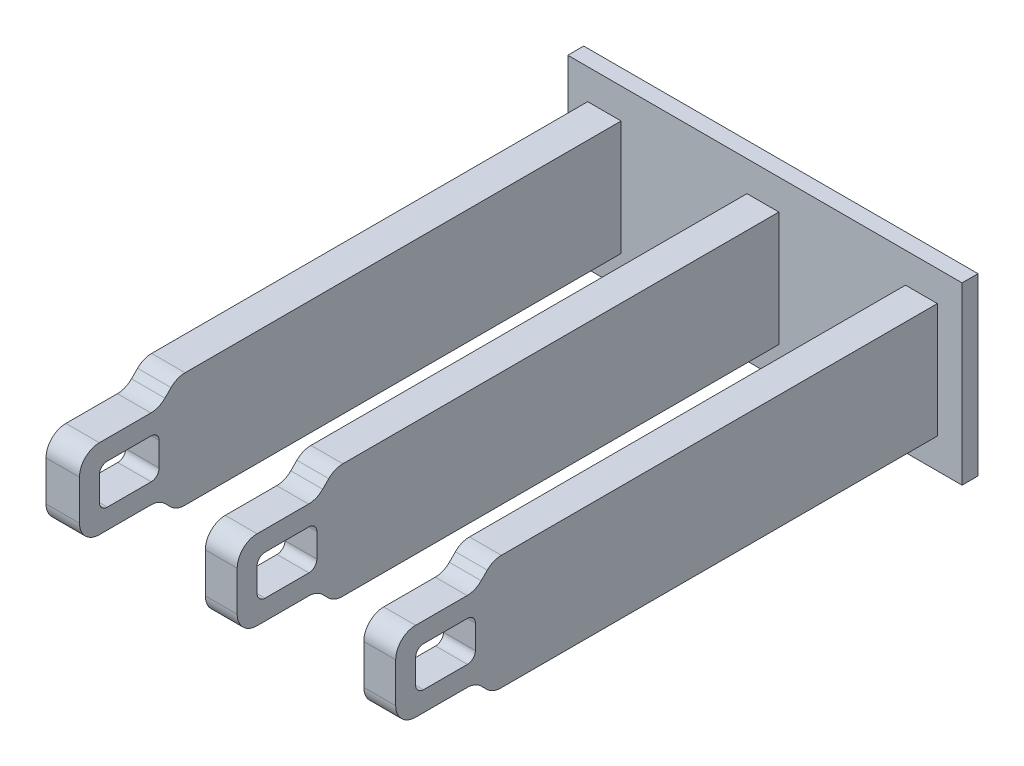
ISO-10303-21;
HEADER;
FILE_DESCRIPTION(('STEP AP214'),'2;1');
FILE_NAME('part.step','',(''),(''),'','','');
FILE_SCHEMA(('AUTOMOTIVE_DESIGN { 1 0 10303 214 1 1 1 1 }'));
ENDSEC;
DATA;
#1=APPLICATION_CONTEXT('core data for automotive mechanical design processes');
#2=APPLICATION_PROTOCOL_DEFINITION('international standard','automotive_design',2000,#1);
#3=PRODUCT_CONTEXT('',#1,'mechanical');
#4=PRODUCT('Part','Part','',(#3));
#5=PRODUCT_RELATED_PRODUCT_CATEGORY('part','',(#4));
#6=PRODUCT_DEFINITION_FORMATION('','',#4);
#7=PRODUCT_DEFINITION_CONTEXT('part definition',#1,'design');
#8=PRODUCT_DEFINITION('design','',#6,#7);
#9=PRODUCT_DEFINITION_SHAPE('','',#8);
#10=(LENGTH_UNIT() NAMED_UNIT(*) SI_UNIT(.MILLI.,.METRE.));
#11=(NAMED_UNIT(*) PLANE_ANGLE_UNIT() SI_UNIT($,.RADIAN.));
#12=(NAMED_UNIT(*) SI_UNIT($,.STERADIAN.) SOLID_ANGLE_UNIT());
#13=UNCERTAINTY_MEASURE_WITH_UNIT(LENGTH_MEASURE(1.E-05),#10,'distance_accuracy_value','');
#14=(GEOMETRIC_REPRESENTATION_CONTEXT(3) GLOBAL_UNCERTAINTY_ASSIGNED_CONTEXT((#13)) GLOBAL_UNIT_ASSIGNED_CONTEXT((#10,
#11,#12)) REPRESENTATION_CONTEXT('',''));
#15=CARTESIAN_POINT('',(0.,0.,0.));
#16=DIRECTION('',(0.,0.,1.));
#17=DIRECTION('',(1.,0.,0.));
#18=AXIS2_PLACEMENT_3D('',#15,#16,#17);
#19=CARTESIAN_POINT('',(0.,4.4,14.));
#20=DIRECTION('',(0.,-1.,0.));
#21=DIRECTION('',(0.,0.,-1.));
#22=AXIS2_PLACEMENT_3D('',#19,#20,#21);
#23=PLANE('',#22);
#24=DIRECTION('',(-1.,0.,0.));
#25=VECTOR('',#24,1.);
#26=CARTESIAN_POINT('',(0.,4.4,0.400000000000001));
#27=LINE('',#26,#25);
#28=CARTESIAN_POINT('',(9.9,4.4,0.400000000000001));
#29=VERTEX_POINT('',#28);
#30=CARTESIAN_POINT('',(0.,4.4,0.400000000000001));
#31=VERTEX_POINT('',#30);
#32=EDGE_CURVE('E534',#29,#31,#27,.T.);
#33=ORIENTED_EDGE('',*,*,#32,.F.);
#34=DIRECTION('',(0.,0.,-1.));
#35=VECTOR('',#34,1.);
#36=CARTESIAN_POINT('',(9.9,4.4,14.));
#37=LINE('',#36,#35);
#38=CARTESIAN_POINT('',(9.9,4.4,0.));
#39=VERTEX_POINT('',#38);
#40=EDGE_CURVE('E554',#29,#39,#37,.T.);
#41=ORIENTED_EDGE('',*,*,#40,.T.);
#42=DIRECTION('',(-1.,0.,0.));
#43=VECTOR('',#42,1.);
#44=CARTESIAN_POINT('',(0.,4.4,0.));
#45=LINE('',#44,#43);
#46=CARTESIAN_POINT('',(0.,4.4,0.));
#47=VERTEX_POINT('',#46);
#48=EDGE_CURVE('E549',#39,#47,#45,.T.);
#49=ORIENTED_EDGE('',*,*,#48,.T.);
#50=DIRECTION('',(0.,0.,-1.));
#51=VECTOR('',#50,1.);
#52=CARTESIAN_POINT('',(0.,4.4,14.));
#53=LINE('',#52,#51);
#54=EDGE_CURVE('E552',#31,#47,#53,.T.);
#55=ORIENTED_EDGE('',*,*,#54,.F.);
#56=EDGE_LOOP('',(#33,#41,#49,#55));
#57=FACE_BOUND('',#56,.T.);
#58=ADVANCED_FACE('F32',(#57),#23,.F.);
#59=CARTESIAN_POINT('',(9.9,0.,14.));
#60=DIRECTION('',(-1.,0.,0.));
#61=DIRECTION('',(0.,0.,1.));
#62=AXIS2_PLACEMENT_3D('',#59,#60,#61);
#63=PLANE('',#62);
#64=DIRECTION('',(0.,1.,0.));
#65=VECTOR('',#64,1.);
#66=CARTESIAN_POINT('',(9.9,0.,0.400000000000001));
#67=LINE('',#66,#65);
#68=CARTESIAN_POINT('',(9.9,0.,0.400000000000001));
#69=VERTEX_POINT('',#68);
#70=EDGE_CURVE('E495',#69,#29,#67,.T.);
#71=ORIENTED_EDGE('',*,*,#70,.F.);
#72=DIRECTION('',(0.,0.,-1.));
#73=VECTOR('',#72,1.);
#74=CARTESIAN_POINT('',(9.9,0.,14.));
#75=LINE('',#74,#73);
#76=CARTESIAN_POINT('',(9.9,0.,0.));
#77=VERTEX_POINT('',#76);
#78=EDGE_CURVE('E556',#69,#77,#75,.T.);
#79=ORIENTED_EDGE('',*,*,#78,.T.);
#80=DIRECTION('',(0.,1.,0.));
#81=VECTOR('',#80,1.);
#82=CARTESIAN_POINT('',(9.9,0.,0.));
#83=LINE('',#82,#81);
#84=EDGE_CURVE('E546',#77,#39,#83,.T.);
#85=ORIENTED_EDGE('',*,*,#84,.T.);
#86=ORIENTED_EDGE('',*,*,#40,.F.);
#87=EDGE_LOOP('',(#71,#79,#85,#86));
#88=FACE_BOUND('',#87,.T.);
#89=ADVANCED_FACE('F850',(#88),#63,.F.);
#90=CARTESIAN_POINT('',(0.,0.,14.));
#91=DIRECTION('',(0.,1.,0.));
#92=DIRECTION('',(0.,0.,1.));
#93=AXIS2_PLACEMENT_3D('',#90,#91,#92);
#94=PLANE('',#93);
#95=ORIENTED_EDGE('',*,*,#78,.F.);
#96=DIRECTION('',(1.,0.,0.));
#97=VECTOR('',#96,1.);
#98=CARTESIAN_POINT('',(0.,0.,0.400000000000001));
#99=LINE('',#98,#97);
#100=CARTESIAN_POINT('',(0.,0.,0.400000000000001));
#101=VERTEX_POINT('',#100);
#102=EDGE_CURVE('E530',#101,#69,#99,.T.);
#103=ORIENTED_EDGE('',*,*,#102,.F.);
#104=DIRECTION('',(0.,0.,-1.));
#105=VECTOR('',#104,1.);
#106=CARTESIAN_POINT('',(0.,0.,14.));
#107=LINE('',#106,#105);
#108=CARTESIAN_POINT('',(0.,0.,0.));
#109=VERTEX_POINT('',#108);
#110=EDGE_CURVE('E558',#101,#109,#107,.T.);
#111=ORIENTED_EDGE('',*,*,#110,.T.);
#112=DIRECTION('',(1.,0.,0.));
#113=VECTOR('',#112,1.);
#114=CARTESIAN_POINT('',(0.,0.,0.));
#115=LINE('',#114,#113);
#116=EDGE_CURVE('E543',#109,#77,#115,.T.);
#117=ORIENTED_EDGE('',*,*,#116,.T.);
#118=EDGE_LOOP('',(#95,#103,#111,#117));
#119=FACE_BOUND('',#118,.T.);
#120=ADVANCED_FACE('F856',(#119),#94,.F.);
#121=CARTESIAN_POINT('',(0.,0.,14.));
#122=DIRECTION('',(0.,0.,-1.));
#123=DIRECTION('',(-1.,0.,0.));
#124=AXIS2_PLACEMENT_3D('',#121,#122,#123);
#125=PLANE('',#124);
#126=DIRECTION('',(0.,-1.,0.));
#127=VECTOR('',#126,1.);
#128=CARTESIAN_POINT('',(8.48,0.,14.));
#129=LINE('',#128,#127);
#130=CARTESIAN_POINT('',(8.48,2.69435804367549,14.));
#131=VERTEX_POINT('',#130);
#132=CARTESIAN_POINT('',(8.48,1.69435804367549,14.));
#133=VERTEX_POINT('',#132);
#134=EDGE_CURVE('E499',#131,#133,#129,.T.);
#135=ORIENTED_EDGE('',*,*,#134,.T.);
#136=DIRECTION('',(1.,0.,0.));
#137=VECTOR('',#136,1.);
#138=CARTESIAN_POINT('',(0.,1.69435804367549,14.));
#139=LINE('',#138,#137);
#140=CARTESIAN_POINT('',(9.28,1.69435804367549,14.));
#141=VERTEX_POINT('',#140);
#142=EDGE_CURVE('E697',#133,#141,#139,.T.);
#143=ORIENTED_EDGE('',*,*,#142,.T.);
#144=DIRECTION('',(0.,-1.,0.));
#145=VECTOR('',#144,1.);
#146=CARTESIAN_POINT('',(9.28,0.,14.));
#147=LINE('',#146,#145);
#148=CARTESIAN_POINT('',(9.28,2.69435804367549,14.));
#149=VERTEX_POINT('',#148);
#150=EDGE_CURVE('E496',#149,#141,#147,.T.);
#151=ORIENTED_EDGE('',*,*,#150,.F.);
#152=DIRECTION('',(1.,0.,0.));
#153=VECTOR('',#152,1.);
#154=CARTESIAN_POINT('',(0.,2.69435804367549,14.));
#155=LINE('',#154,#153);
#156=EDGE_CURVE('E695',#149,#131,#155,.F.);
#157=ORIENTED_EDGE('',*,*,#156,.T.);
#158=EDGE_LOOP('',(#135,#143,#151,#157));
#159=FACE_BOUND('',#158,.T.);
#160=ADVANCED_FACE('F865',(#159),#125,.F.);
#161=DIRECTION('',(0.,-1.,0.));
#162=VECTOR('',#161,1.);
#163=CARTESIAN_POINT('',(4.5,0.,14.));
#164=LINE('',#163,#162);
#165=CARTESIAN_POINT('',(4.5,2.69435804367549,14.));
#166=VERTEX_POINT('',#165);
#167=CARTESIAN_POINT('',(4.5,1.69435804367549,14.));
#168=VERTEX_POINT('',#167);
#169=EDGE_CURVE('E513',#166,#168,#164,.T.);
#170=ORIENTED_EDGE('',*,*,#169,.T.);
#171=DIRECTION('',(1.,0.,0.));
#172=VECTOR('',#171,1.);
#173=CARTESIAN_POINT('',(0.,1.69435804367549,14.));
#174=LINE('',#173,#172);
#175=CARTESIAN_POINT('',(5.3,1.69435804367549,14.));
#176=VERTEX_POINT('',#175);
#177=EDGE_CURVE('E644',#168,#176,#174,.T.);
#178=ORIENTED_EDGE('',*,*,#177,.T.);
#179=DIRECTION('',(0.,-1.,0.));
#180=VECTOR('',#179,1.);
#181=CARTESIAN_POINT('',(5.3,0.,14.));
#182=LINE('',#181,#180);
#183=CARTESIAN_POINT('',(5.3,2.69435804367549,14.));
#184=VERTEX_POINT('',#183);
#185=EDGE_CURVE('E510',#184,#176,#182,.T.);
#186=ORIENTED_EDGE('',*,*,#185,.F.);
#187=DIRECTION('',(1.,0.,0.));
#188=VECTOR('',#187,1.);
#189=CARTESIAN_POINT('',(0.,2.69435804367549,14.));
#190=LINE('',#189,#188);
#191=EDGE_CURVE('E642',#184,#166,#190,.F.);
#192=ORIENTED_EDGE('',*,*,#191,.T.);
#193=EDGE_LOOP('',(#170,#178,#186,#192));
#194=FACE_BOUND('',#193,.T.);
#195=ADVANCED_FACE('F871',(#194),#125,.F.);
#196=CARTESIAN_POINT('',(0.,0.,14.));
#197=DIRECTION('',(1.,0.,0.));
#198=DIRECTION('',(0.,0.,-1.));
#199=AXIS2_PLACEMENT_3D('',#196,#197,#198);
#200=PLANE('',#199);
#201=DIRECTION('',(0.,-1.,0.));
#202=VECTOR('',#201,1.);
#203=CARTESIAN_POINT('',(0.,0.,0.400000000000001));
#204=LINE('',#203,#202);
#205=EDGE_CURVE('E536',#31,#101,#204,.T.);
#206=ORIENTED_EDGE('',*,*,#205,.F.);
#207=ORIENTED_EDGE('',*,*,#54,.T.);
#208=DIRECTION('',(0.,-1.,0.));
#209=VECTOR('',#208,1.);
#210=CARTESIAN_POINT('',(0.,0.,0.));
#211=LINE('',#210,#209);
#212=EDGE_CURVE('E538',#47,#109,#211,.T.);
#213=ORIENTED_EDGE('',*,*,#212,.T.);
#214=ORIENTED_EDGE('',*,*,#110,.F.);
#215=EDGE_LOOP('',(#206,#207,#213,#214));
#216=FACE_BOUND('',#215,.T.);
#217=ADVANCED_FACE('F867',(#216),#200,.F.);
#218=DIRECTION('',(0.,1.,0.));
#219=VECTOR('',#218,1.);
#220=CARTESIAN_POINT('',(0.5,0.,14.));
#221=LINE('',#220,#219);
#222=CARTESIAN_POINT('',(0.5,1.69435804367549,14.));
#223=VERTEX_POINT('',#222);
#224=CARTESIAN_POINT('',(0.5,2.69435804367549,14.));
#225=VERTEX_POINT('',#224);
#226=EDGE_CURVE('E525',#223,#225,#221,.T.);
#227=ORIENTED_EDGE('',*,*,#226,.F.);
#228=DIRECTION('',(1.,0.,0.));
#229=VECTOR('',#228,1.);
#230=CARTESIAN_POINT('',(0.,1.69435804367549,14.));
#231=LINE('',#230,#229);
#232=CARTESIAN_POINT('',(1.34,1.69435804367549,14.));
#233=VERTEX_POINT('',#232);
#234=EDGE_CURVE('E590',#223,#233,#231,.T.);
#235=ORIENTED_EDGE('',*,*,#234,.T.);
#236=DIRECTION('',(0.,-1.,0.));
#237=VECTOR('',#236,1.);
#238=CARTESIAN_POINT('',(1.34,0.,14.));
#239=LINE('',#238,#237);
#240=CARTESIAN_POINT('',(1.34,2.69435804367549,14.));
#241=VERTEX_POINT('',#240);
#242=EDGE_CURVE('E522',#241,#233,#239,.T.);
#243=ORIENTED_EDGE('',*,*,#242,.F.);
#244=DIRECTION('',(1.,0.,0.));
#245=VECTOR('',#244,1.);
#246=CARTESIAN_POINT('',(0.,2.69435804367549,14.));
#247=LINE('',#246,#245);
#248=EDGE_CURVE('E588',#241,#225,#247,.F.);
#249=ORIENTED_EDGE('',*,*,#248,.T.);
#250=EDGE_LOOP('',(#227,#235,#243,#249));
#251=FACE_BOUND('',#250,.T.);
#252=ADVANCED_FACE('F870',(#251),#125,.F.);
#253=CARTESIAN_POINT('',(0.,0.,0.));
#254=DIRECTION('',(0.,0.,-1.));
#255=DIRECTION('',(-1.,0.,0.));
#256=AXIS2_PLACEMENT_3D('',#253,#254,#255);
#257=PLANE('',#256);
#258=ORIENTED_EDGE('',*,*,#212,.F.);
#259=ORIENTED_EDGE('',*,*,#48,.F.);
#260=ORIENTED_EDGE('',*,*,#84,.F.);
#261=ORIENTED_EDGE('',*,*,#116,.F.);
#262=EDGE_LOOP('',(#258,#259,#260,#261));
#263=FACE_BOUND('',#262,.T.);
#264=ADVANCED_FACE('F860',(#263),#257,.T.);
#265=CARTESIAN_POINT('',(0.5,0.,0.400000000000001));
#266=DIRECTION('',(1.,0.,0.));
#267=DIRECTION('',(0.,1.,0.));
#268=AXIS2_PLACEMENT_3D('',#265,#266,#267);
#269=PLANE('',#268);
#270=DIRECTION('',(0.,1.,0.));
#271=VECTOR('',#270,1.);
#272=CARTESIAN_POINT('',(0.5,0.,12.));
#273=LINE('',#272,#271);
#274=CARTESIAN_POINT('',(0.5,1.89435804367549,12.));
#275=VERTEX_POINT('',#274);
#276=CARTESIAN_POINT('',(0.5,2.49435804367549,12.));
#277=VERTEX_POINT('',#276);
#278=EDGE_CURVE('E1010',#275,#277,#273,.T.);
#279=ORIENTED_EDGE('',*,*,#278,.T.);
#280=CARTESIAN_POINT('',(0.5,2.49435804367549,12.2));
#281=DIRECTION('',(1.,0.,0.));
#282=DIRECTION('',(0.,1.,0.));
#283=AXIS2_PLACEMENT_3D('',#280,#281,#282);
#284=CIRCLE('',#283,0.2);
#285=CARTESIAN_POINT('',(0.5,2.69435804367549,12.2));
#286=VERTEX_POINT('',#285);
#287=EDGE_CURVE('E802',#277,#286,#284,.T.);
#288=ORIENTED_EDGE('',*,*,#287,.T.);
#289=DIRECTION('',(0.,0.,1.));
#290=VECTOR('',#289,1.);
#291=CARTESIAN_POINT('',(0.5,2.69435804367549,0.400000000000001));
#292=LINE('',#291,#290);
#293=CARTESIAN_POINT('',(0.5,2.69435804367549,13.3));
#294=VERTEX_POINT('',#293);
#295=EDGE_CURVE('E1023',#286,#294,#292,.T.);
#296=ORIENTED_EDGE('',*,*,#295,.T.);
#297=CARTESIAN_POINT('',(0.5,2.49435804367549,13.3));
#298=DIRECTION('',(1.,0.,0.));
#299=DIRECTION('',(0.,1.,0.));
#300=AXIS2_PLACEMENT_3D('',#297,#298,#299);
#301=CIRCLE('',#300,0.2);
#302=CARTESIAN_POINT('',(0.5,2.49435804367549,13.5));
#303=VERTEX_POINT('',#302);
#304=EDGE_CURVE('E790',#294,#303,#301,.T.);
#305=ORIENTED_EDGE('',*,*,#304,.T.);
#306=DIRECTION('',(0.,-1.,0.));
#307=VECTOR('',#306,1.);
#308=CARTESIAN_POINT('',(0.5,0.,13.5));
#309=LINE('',#308,#307);
#310=CARTESIAN_POINT('',(0.5,1.89435804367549,13.5));
#311=VERTEX_POINT('',#310);
#312=EDGE_CURVE('E1033',#303,#311,#309,.T.);
#313=ORIENTED_EDGE('',*,*,#312,.T.);
#314=CARTESIAN_POINT('',(0.5,1.89435804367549,13.3));
#315=DIRECTION('',(1.,0.,0.));
#316=DIRECTION('',(0.,1.,0.));
#317=AXIS2_PLACEMENT_3D('',#314,#315,#316);
#318=CIRCLE('',#317,0.2);
#319=CARTESIAN_POINT('',(0.5,1.69435804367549,13.3));
#320=VERTEX_POINT('',#319);
#321=EDGE_CURVE('E782',#311,#320,#318,.T.);
#322=ORIENTED_EDGE('',*,*,#321,.T.);
#323=DIRECTION('',(0.,0.,-1.));
#324=VECTOR('',#323,1.);
#325=CARTESIAN_POINT('',(0.5,1.69435804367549,0.400000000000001));
#326=LINE('',#325,#324);
#327=CARTESIAN_POINT('',(0.5,1.69435804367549,12.2));
#328=VERTEX_POINT('',#327);
#329=EDGE_CURVE('E1004',#320,#328,#326,.T.);
#330=ORIENTED_EDGE('',*,*,#329,.T.);
#331=CARTESIAN_POINT('',(0.5,1.89435804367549,12.2));
#332=DIRECTION('',(1.,0.,0.));
#333=DIRECTION('',(0.,1.,0.));
#334=AXIS2_PLACEMENT_3D('',#331,#332,#333);
#335=CIRCLE('',#334,0.2);
#336=EDGE_CURVE('E798',#328,#275,#335,.T.);
#337=ORIENTED_EDGE('',*,*,#336,.T.);
#338=EDGE_LOOP('',(#279,#288,#296,#305,#313,#322,#330,#337));
#339=FACE_BOUND('',#338,.T.);
#340=DIRECTION('',(0.,0.,1.));
#341=VECTOR('',#340,1.);
#342=CARTESIAN_POINT('',(0.500000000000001,0.76,0.400000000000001));
#343=LINE('',#342,#341);
#344=CARTESIAN_POINT('',(0.500000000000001,0.76,0.400000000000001));
#345=VERTEX_POINT('',#344);
#346=CARTESIAN_POINT('',(0.500000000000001,0.76,11.358535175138));
#347=VERTEX_POINT('',#346);
#348=EDGE_CURVE('E490',#345,#347,#343,.T.);
#349=ORIENTED_EDGE('',*,*,#348,.T.);
#350=CARTESIAN_POINT('',(0.5,1.26,11.358535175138));
#351=DIRECTION('',(1.,0.,0.));
#352=DIRECTION('',(0.,1.,0.));
#353=AXIS2_PLACEMENT_3D('',#350,#351,#352);
#354=CIRCLE('',#353,0.5);
#355=CARTESIAN_POINT('',(0.5,0.906446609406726,11.7120885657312));
#356=VERTEX_POINT('',#355);
#357=EDGE_CURVE('E569',#347,#356,#354,.F.);
#358=ORIENTED_EDGE('',*,*,#357,.T.);
#359=DIRECTION('',(0.,0.707106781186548,0.707106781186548));
#360=VECTOR('',#359,1.);
#361=CARTESIAN_POINT('',(0.499999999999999,-5.20282097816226,5.60282097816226));
#362=LINE('',#361,#360);
#363=CARTESIAN_POINT('',(0.5,1.04791143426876,11.8535533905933));
#364=VERTEX_POINT('',#363);
#365=EDGE_CURVE('E1293',#356,#364,#362,.T.);
#366=ORIENTED_EDGE('',*,*,#365,.T.);
#367=CARTESIAN_POINT('',(0.5,0.694358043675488,12.2071067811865));
#368=DIRECTION('',(1.,0.,0.));
#369=DIRECTION('',(0.,1.,0.));
#370=AXIS2_PLACEMENT_3D('',#367,#368,#369);
#371=CIRCLE('',#370,0.5);
#372=CARTESIAN_POINT('',(0.5,1.19435804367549,12.2071067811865));
#373=VERTEX_POINT('',#372);
#374=EDGE_CURVE('E608',#364,#373,#371,.T.);
#375=ORIENTED_EDGE('',*,*,#374,.T.);
#376=DIRECTION('',(0.,0.,1.));
#377=VECTOR('',#376,1.);
#378=CARTESIAN_POINT('',(0.5,1.19435804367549,0.400000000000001));
#379=LINE('',#378,#377);
#380=CARTESIAN_POINT('',(0.5,1.19435804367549,13.5));
#381=VERTEX_POINT('',#380);
#382=EDGE_CURVE('E1307',#373,#381,#379,.T.);
#383=ORIENTED_EDGE('',*,*,#382,.T.);
#384=CARTESIAN_POINT('',(0.5,1.69435804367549,13.5));
#385=DIRECTION('',(1.,0.,0.));
#386=DIRECTION('',(0.,1.,0.));
#387=AXIS2_PLACEMENT_3D('',#384,#385,#386);
#388=CIRCLE('',#387,0.5);
#389=EDGE_CURVE('E567',#381,#223,#388,.F.);
#390=ORIENTED_EDGE('',*,*,#389,.T.);
#391=ORIENTED_EDGE('',*,*,#226,.T.);
#392=CARTESIAN_POINT('',(0.5,2.69435804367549,13.5));
#393=DIRECTION('',(1.,0.,0.));
#394=DIRECTION('',(0.,1.,0.));
#395=AXIS2_PLACEMENT_3D('',#392,#393,#394);
#396=CIRCLE('',#395,0.5);
#397=CARTESIAN_POINT('',(0.5,3.19435804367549,13.5));
#398=VERTEX_POINT('',#397);
#399=EDGE_CURVE('E565',#225,#398,#396,.F.);
#400=ORIENTED_EDGE('',*,*,#399,.T.);
#401=DIRECTION('',(0.,0.,-1.));
#402=VECTOR('',#401,1.);
#403=CARTESIAN_POINT('',(0.5,3.19435804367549,0.400000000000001));
#404=LINE('',#403,#402);
#405=CARTESIAN_POINT('',(0.5,3.19435804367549,12.2071067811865));
#406=VERTEX_POINT('',#405);
#407=EDGE_CURVE('E1115',#398,#406,#404,.T.);
#408=ORIENTED_EDGE('',*,*,#407,.T.);
#409=CARTESIAN_POINT('',(0.5,3.69435804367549,12.2071067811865));
#410=DIRECTION('',(1.,0.,0.));
#411=DIRECTION('',(0.,1.,0.));
#412=AXIS2_PLACEMENT_3D('',#409,#410,#411);
#413=CIRCLE('',#412,0.5);
#414=CARTESIAN_POINT('',(0.5,3.34080465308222,11.8535533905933));
#415=VERTEX_POINT('',#414);
#416=EDGE_CURVE('E612',#406,#415,#413,.T.);
#417=ORIENTED_EDGE('',*,*,#416,.T.);
#418=DIRECTION('',(0.,0.70710678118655,-0.707106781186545));
#419=VECTOR('',#418,1.);
#420=CARTESIAN_POINT('',(0.500000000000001,7.39717902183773,7.79717902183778));
#421=LINE('',#420,#419);
#422=CARTESIAN_POINT('',(0.5,3.49355339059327,11.7008046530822));
#423=VERTEX_POINT('',#422);
#424=EDGE_CURVE('E1100',#415,#423,#421,.T.);
#425=ORIENTED_EDGE('',*,*,#424,.T.);
#426=CARTESIAN_POINT('',(0.5,3.14,11.3472512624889));
#427=DIRECTION('',(1.,0.,0.));
#428=DIRECTION('',(0.,1.,0.));
#429=AXIS2_PLACEMENT_3D('',#426,#427,#428);
#430=CIRCLE('',#429,0.5);
#431=CARTESIAN_POINT('',(0.500000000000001,3.64,11.3472512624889));
#432=VERTEX_POINT('',#431);
#433=EDGE_CURVE('E563',#423,#432,#430,.F.);
#434=ORIENTED_EDGE('',*,*,#433,.T.);
#435=DIRECTION('',(0.,0.,1.));
#436=VECTOR('',#435,1.);
#437=CARTESIAN_POINT('',(0.500000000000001,3.64,0.400000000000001));
#438=LINE('',#437,#436);
#439=CARTESIAN_POINT('',(0.500000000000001,3.64,0.400000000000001));
#440=VERTEX_POINT('',#439);
#441=EDGE_CURVE('E1047',#440,#432,#438,.T.);
#442=ORIENTED_EDGE('',*,*,#441,.F.);
#443=DIRECTION('',(0.,1.,0.));
#444=VECTOR('',#443,1.);
#445=CARTESIAN_POINT('',(0.5,0.,0.400000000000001));
#446=LINE('',#445,#444);
#447=EDGE_CURVE('E532',#345,#440,#446,.T.);
#448=ORIENTED_EDGE('',*,*,#447,.F.);
#449=EDGE_LOOP('',(#349,#358,#366,#375,#383,#390,#391,#400,#408,#417,#425,#434,#442,#448));
#450=FACE_BOUND('',#449,.T.);
#451=ADVANCED_FACE('F1141',(#339,#450),#269,.F.);
#452=CARTESIAN_POINT('',(0.,0.,0.400000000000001));
#453=DIRECTION('',(0.,0.,1.));
#454=DIRECTION('',(1.,0.,0.));
#455=AXIS2_PLACEMENT_3D('',#452,#453,#454);
#456=PLANE('',#455);
#457=DIRECTION('',(-1.,0.,0.));
#458=VECTOR('',#457,1.);
#459=CARTESIAN_POINT('',(0.500000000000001,0.76,0.400000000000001));
#460=LINE('',#459,#458);
#461=CARTESIAN_POINT('',(1.34,0.76,0.400000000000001));
#462=VERTEX_POINT('',#461);
#463=EDGE_CURVE('E482',#462,#345,#460,.T.);
#464=ORIENTED_EDGE('',*,*,#463,.T.);
#465=ORIENTED_EDGE('',*,*,#447,.T.);
#466=DIRECTION('',(1.,0.,0.));
#467=VECTOR('',#466,1.);
#468=CARTESIAN_POINT('',(0.500000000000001,3.64,0.400000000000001));
#469=LINE('',#468,#467);
#470=CARTESIAN_POINT('',(1.34,3.64,0.400000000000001));
#471=VERTEX_POINT('',#470);
#472=EDGE_CURVE('E1045',#440,#471,#469,.T.);
#473=ORIENTED_EDGE('',*,*,#472,.T.);
#474=DIRECTION('',(0.,-1.,0.));
#475=VECTOR('',#474,1.);
#476=CARTESIAN_POINT('',(1.34,0.,0.400000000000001));
#477=LINE('',#476,#475);
#478=EDGE_CURVE('E521',#471,#462,#477,.T.);
#479=ORIENTED_EDGE('',*,*,#478,.T.);
#480=EDGE_LOOP('',(#464,#465,#473,#479));
#481=FACE_BOUND('',#480,.T.);
#482=DIRECTION('',(0.,-1.,0.));
#483=VECTOR('',#482,1.);
#484=CARTESIAN_POINT('',(5.3,0.,0.400000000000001));
#485=LINE('',#484,#483);
#486=CARTESIAN_POINT('',(5.3,3.64,0.400000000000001));
#487=VERTEX_POINT('',#486);
#488=CARTESIAN_POINT('',(5.3,0.76,0.400000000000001));
#489=VERTEX_POINT('',#488);
#490=EDGE_CURVE('E509',#487,#489,#485,.T.);
#491=ORIENTED_EDGE('',*,*,#490,.T.);
#492=CARTESIAN_POINT('',(4.5,0.76,0.400000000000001));
#493=VERTEX_POINT('',#492);
#494=EDGE_CURVE('E480',#489,#493,#460,.T.);
#495=ORIENTED_EDGE('',*,*,#494,.T.);
#496=DIRECTION('',(0.,-1.,0.));
#497=VECTOR('',#496,1.);
#498=CARTESIAN_POINT('',(4.5,0.,0.400000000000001));
#499=LINE('',#498,#497);
#500=CARTESIAN_POINT('',(4.5,3.64,0.400000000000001));
#501=VERTEX_POINT('',#500);
#502=EDGE_CURVE('E518',#501,#493,#499,.T.);
#503=ORIENTED_EDGE('',*,*,#502,.F.);
#504=EDGE_CURVE('E1048',#501,#487,#469,.T.);
#505=ORIENTED_EDGE('',*,*,#504,.T.);
#506=EDGE_LOOP('',(#491,#495,#503,#505));
#507=FACE_BOUND('',#506,.T.);
#508=ORIENTED_EDGE('',*,*,#102,.T.);
#509=ORIENTED_EDGE('',*,*,#70,.T.);
#510=ORIENTED_EDGE('',*,*,#32,.T.);
#511=ORIENTED_EDGE('',*,*,#205,.T.);
#512=EDGE_LOOP('',(#508,#509,#510,#511));
#513=FACE_BOUND('',#512,.T.);
#514=CARTESIAN_POINT('',(9.28,0.76,0.400000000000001));
#515=VERTEX_POINT('',#514);
#516=CARTESIAN_POINT('',(8.48,0.76,0.400000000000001));
#517=VERTEX_POINT('',#516);
#518=EDGE_CURVE('E469',#515,#517,#460,.T.);
#519=ORIENTED_EDGE('',*,*,#518,.T.);
#520=DIRECTION('',(0.,-1.,0.));
#521=VECTOR('',#520,1.);
#522=CARTESIAN_POINT('',(8.48,0.,0.400000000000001));
#523=LINE('',#522,#521);
#524=CARTESIAN_POINT('',(8.48,3.64,0.400000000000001));
#525=VERTEX_POINT('',#524);
#526=EDGE_CURVE('E507',#525,#517,#523,.T.);
#527=ORIENTED_EDGE('',*,*,#526,.F.);
#528=CARTESIAN_POINT('',(9.28,3.64,0.400000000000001));
#529=VERTEX_POINT('',#528);
#530=EDGE_CURVE('E494',#525,#529,#469,.T.);
#531=ORIENTED_EDGE('',*,*,#530,.T.);
#532=DIRECTION('',(0.,-1.,0.));
#533=VECTOR('',#532,1.);
#534=CARTESIAN_POINT('',(9.28,0.,0.400000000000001));
#535=LINE('',#534,#533);
#536=EDGE_CURVE('E488',#529,#515,#535,.T.);
#537=ORIENTED_EDGE('',*,*,#536,.T.);
#538=EDGE_LOOP('',(#519,#527,#531,#537));
#539=FACE_BOUND('',#538,.T.);
#540=ADVANCED_FACE('F493',(#481,#507,#513,#539),#456,.T.);
#541=CARTESIAN_POINT('',(4.5,0.,0.400000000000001));
#542=DIRECTION('',(-1.,0.,0.));
#543=DIRECTION('',(0.,-1.,0.));
#544=AXIS2_PLACEMENT_3D('',#541,#542,#543);
#545=PLANE('',#544);
#546=DIRECTION('',(0.,0.,-1.));
#547=VECTOR('',#546,1.);
#548=CARTESIAN_POINT('',(4.5,0.76,0.400000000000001));
#549=LINE('',#548,#547);
#550=CARTESIAN_POINT('',(4.5,0.76,11.358535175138));
#551=VERTEX_POINT('',#550);
#552=EDGE_CURVE('E1043',#551,#493,#549,.T.);
#553=ORIENTED_EDGE('',*,*,#552,.F.);
#554=CARTESIAN_POINT('',(4.5,1.26,11.358535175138));
#555=DIRECTION('',(-1.,0.,0.));
#556=DIRECTION('',(0.,-1.,0.));
#557=AXIS2_PLACEMENT_3D('',#554,#555,#556);
#558=CIRCLE('',#557,0.5);
#559=CARTESIAN_POINT('',(4.5,0.906446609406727,11.7120885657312));
#560=VERTEX_POINT('',#559);
#561=EDGE_CURVE('E635',#551,#560,#558,.T.);
#562=ORIENTED_EDGE('',*,*,#561,.T.);
#563=DIRECTION('',(0.,-0.707106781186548,-0.707106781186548));
#564=VECTOR('',#563,1.);
#565=CARTESIAN_POINT('',(4.5,-5.20282097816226,5.60282097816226));
#566=LINE('',#565,#564);
#567=CARTESIAN_POINT('',(4.5,1.04791143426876,11.8535533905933));
#568=VERTEX_POINT('',#567);
#569=EDGE_CURVE('E1299',#568,#560,#566,.T.);
#570=ORIENTED_EDGE('',*,*,#569,.F.);
#571=CARTESIAN_POINT('',(4.5,0.694358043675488,12.2071067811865));
#572=DIRECTION('',(-1.,0.,0.));
#573=DIRECTION('',(0.,-1.,0.));
#574=AXIS2_PLACEMENT_3D('',#571,#572,#573);
#575=CIRCLE('',#574,0.5);
#576=CARTESIAN_POINT('',(4.5,1.19435804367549,12.2071067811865));
#577=VERTEX_POINT('',#576);
#578=EDGE_CURVE('E662',#568,#577,#575,.F.);
#579=ORIENTED_EDGE('',*,*,#578,.T.);
#580=DIRECTION('',(0.,0.,-1.));
#581=VECTOR('',#580,1.);
#582=CARTESIAN_POINT('',(4.5,1.19435804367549,0.400000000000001));
#583=LINE('',#582,#581);
#584=CARTESIAN_POINT('',(4.5,1.19435804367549,13.5));
#585=VERTEX_POINT('',#584);
#586=EDGE_CURVE('E1305',#585,#577,#583,.T.);
#587=ORIENTED_EDGE('',*,*,#586,.F.);
#588=CARTESIAN_POINT('',(4.5,1.69435804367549,13.5));
#589=DIRECTION('',(-1.,0.,0.));
#590=DIRECTION('',(0.,-1.,0.));
#591=AXIS2_PLACEMENT_3D('',#588,#589,#590);
#592=CIRCLE('',#591,0.5);
#593=EDGE_CURVE('E633',#585,#168,#592,.T.);
#594=ORIENTED_EDGE('',*,*,#593,.T.);
#595=ORIENTED_EDGE('',*,*,#169,.F.);
#596=CARTESIAN_POINT('',(4.5,2.69435804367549,13.5));
#597=DIRECTION('',(-1.,0.,0.));
#598=DIRECTION('',(0.,-1.,0.));
#599=AXIS2_PLACEMENT_3D('',#596,#597,#598);
#600=CIRCLE('',#599,0.5);
#601=CARTESIAN_POINT('',(4.5,3.19435804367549,13.5));
#602=VERTEX_POINT('',#601);
#603=EDGE_CURVE('E631',#166,#602,#600,.T.);
#604=ORIENTED_EDGE('',*,*,#603,.T.);
#605=DIRECTION('',(0.,0.,1.));
#606=VECTOR('',#605,1.);
#607=CARTESIAN_POINT('',(4.5,3.19435804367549,0.400000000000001));
#608=LINE('',#607,#606);
#609=CARTESIAN_POINT('',(4.5,3.19435804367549,12.2071067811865));
#610=VERTEX_POINT('',#609);
#611=EDGE_CURVE('E1112',#610,#602,#608,.T.);
#612=ORIENTED_EDGE('',*,*,#611,.F.);
#613=CARTESIAN_POINT('',(4.5,3.69435804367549,12.2071067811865));
#614=DIRECTION('',(-1.,0.,0.));
#615=DIRECTION('',(0.,-1.,0.));
#616=AXIS2_PLACEMENT_3D('',#613,#614,#615);
#617=CIRCLE('',#616,0.5);
#618=CARTESIAN_POINT('',(4.5,3.34080465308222,11.8535533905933));
#619=VERTEX_POINT('',#618);
#620=EDGE_CURVE('E666',#610,#619,#617,.F.);
#621=ORIENTED_EDGE('',*,*,#620,.T.);
#622=DIRECTION('',(0.,-0.70710678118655,0.707106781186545));
#623=VECTOR('',#622,1.);
#624=CARTESIAN_POINT('',(4.5,7.39717902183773,7.79717902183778));
#625=LINE('',#624,#623);
#626=CARTESIAN_POINT('',(4.5,3.49355339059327,11.7008046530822));
#627=VERTEX_POINT('',#626);
#628=EDGE_CURVE('E1098',#627,#619,#625,.T.);
#629=ORIENTED_EDGE('',*,*,#628,.F.);
#630=CARTESIAN_POINT('',(4.5,3.14,11.3472512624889));
#631=DIRECTION('',(-1.,0.,0.));
#632=DIRECTION('',(0.,-1.,0.));
#633=AXIS2_PLACEMENT_3D('',#630,#631,#632);
#634=CIRCLE('',#633,0.5);
#635=CARTESIAN_POINT('',(4.5,3.64,11.3472512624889));
#636=VERTEX_POINT('',#635);
#637=EDGE_CURVE('E629',#627,#636,#634,.T.);
#638=ORIENTED_EDGE('',*,*,#637,.T.);
#639=DIRECTION('',(0.,0.,1.));
#640=VECTOR('',#639,1.);
#641=CARTESIAN_POINT('',(4.5,3.64,0.400000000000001));
#642=LINE('',#641,#640);
#643=EDGE_CURVE('E502',#501,#636,#642,.T.);
#644=ORIENTED_EDGE('',*,*,#643,.F.);
#645=ORIENTED_EDGE('',*,*,#502,.T.);
#646=EDGE_LOOP('',(#553,#562,#570,#579,#587,#594,#595,#604,#612,#621,#629,#638,#644,#645));
#647=FACE_BOUND('',#646,.T.);
#648=DIRECTION('',(0.,1.,0.));
#649=VECTOR('',#648,1.);
#650=CARTESIAN_POINT('',(4.5,0.,13.5));
#651=LINE('',#650,#649);
#652=CARTESIAN_POINT('',(4.5,1.89435804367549,13.5));
#653=VERTEX_POINT('',#652);
#654=CARTESIAN_POINT('',(4.5,2.49435804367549,13.5));
#655=VERTEX_POINT('',#654);
#656=EDGE_CURVE('E1030',#653,#655,#651,.T.);
#657=ORIENTED_EDGE('',*,*,#656,.F.);
#658=CARTESIAN_POINT('',(4.5,1.89435804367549,13.3));
#659=DIRECTION('',(-1.,0.,0.));
#660=DIRECTION('',(0.,-1.,0.));
#661=AXIS2_PLACEMENT_3D('',#658,#659,#660);
#662=CIRCLE('',#661,0.2);
#663=CARTESIAN_POINT('',(4.5,1.69435804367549,13.3));
#664=VERTEX_POINT('',#663);
#665=EDGE_CURVE('E786',#653,#664,#662,.F.);
#666=ORIENTED_EDGE('',*,*,#665,.T.);
#667=DIRECTION('',(0.,0.,1.));
#668=VECTOR('',#667,1.);
#669=CARTESIAN_POINT('',(4.5,1.69435804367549,0.400000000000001));
#670=LINE('',#669,#668);
#671=CARTESIAN_POINT('',(4.5,1.69435804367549,12.2));
#672=VERTEX_POINT('',#671);
#673=EDGE_CURVE('E1135',#672,#664,#670,.T.);
#674=ORIENTED_EDGE('',*,*,#673,.F.);
#675=CARTESIAN_POINT('',(4.5,1.89435804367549,12.2));
#676=DIRECTION('',(-1.,0.,0.));
#677=DIRECTION('',(0.,-1.,0.));
#678=AXIS2_PLACEMENT_3D('',#675,#676,#677);
#679=CIRCLE('',#678,0.2);
#680=CARTESIAN_POINT('',(4.5,1.89435804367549,12.));
#681=VERTEX_POINT('',#680);
#682=EDGE_CURVE('E810',#672,#681,#679,.F.);
#683=ORIENTED_EDGE('',*,*,#682,.T.);
#684=DIRECTION('',(0.,-1.,0.));
#685=VECTOR('',#684,1.);
#686=CARTESIAN_POINT('',(4.5,0.,12.));
#687=LINE('',#686,#685);
#688=CARTESIAN_POINT('',(4.5,2.49435804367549,12.));
#689=VERTEX_POINT('',#688);
#690=EDGE_CURVE('E1001',#689,#681,#687,.T.);
#691=ORIENTED_EDGE('',*,*,#690,.F.);
#692=CARTESIAN_POINT('',(4.5,2.49435804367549,12.2));
#693=DIRECTION('',(-1.,0.,0.));
#694=DIRECTION('',(0.,-1.,0.));
#695=AXIS2_PLACEMENT_3D('',#692,#693,#694);
#696=CIRCLE('',#695,0.2);
#697=CARTESIAN_POINT('',(4.5,2.69435804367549,12.2));
#698=VERTEX_POINT('',#697);
#699=EDGE_CURVE('E806',#689,#698,#696,.F.);
#700=ORIENTED_EDGE('',*,*,#699,.T.);
#701=DIRECTION('',(0.,0.,-1.));
#702=VECTOR('',#701,1.);
#703=CARTESIAN_POINT('',(4.5,2.69435804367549,0.400000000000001));
#704=LINE('',#703,#702);
#705=CARTESIAN_POINT('',(4.5,2.69435804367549,13.3));
#706=VERTEX_POINT('',#705);
#707=EDGE_CURVE('E1020',#706,#698,#704,.T.);
#708=ORIENTED_EDGE('',*,*,#707,.F.);
#709=CARTESIAN_POINT('',(4.5,2.49435804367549,13.3));
#710=DIRECTION('',(-1.,0.,0.));
#711=DIRECTION('',(0.,-1.,0.));
#712=AXIS2_PLACEMENT_3D('',#709,#710,#711);
#713=CIRCLE('',#712,0.2);
#714=EDGE_CURVE('E794',#706,#655,#713,.F.);
#715=ORIENTED_EDGE('',*,*,#714,.T.);
#716=EDGE_LOOP('',(#657,#666,#674,#683,#691,#700,#708,#715));
#717=FACE_BOUND('',#716,.T.);
#718=ADVANCED_FACE('F1230',(#647,#717),#545,.T.);
#719=CARTESIAN_POINT('',(1.34,0.,0.400000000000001));
#720=DIRECTION('',(-1.,0.,0.));
#721=DIRECTION('',(0.,-1.,0.));
#722=AXIS2_PLACEMENT_3D('',#719,#720,#721);
#723=PLANE('',#722);
#724=DIRECTION('',(0.,-1.,0.));
#725=VECTOR('',#724,1.);
#726=CARTESIAN_POINT('',(1.34,0.,12.));
#727=LINE('',#726,#725);
#728=CARTESIAN_POINT('',(1.34,2.49435804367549,12.));
#729=VERTEX_POINT('',#728);
#730=CARTESIAN_POINT('',(1.34,1.89435804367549,12.));
#731=VERTEX_POINT('',#730);
#732=EDGE_CURVE('E997',#729,#731,#727,.T.);
#733=ORIENTED_EDGE('',*,*,#732,.T.);
#734=CARTESIAN_POINT('',(1.34,1.89435804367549,12.2));
#735=DIRECTION('',(-1.,0.,0.));
#736=DIRECTION('',(0.,-1.,0.));
#737=AXIS2_PLACEMENT_3D('',#734,#735,#736);
#738=CIRCLE('',#737,0.2);
#739=CARTESIAN_POINT('',(1.34,1.69435804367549,12.2));
#740=VERTEX_POINT('',#739);
#741=EDGE_CURVE('E796',#731,#740,#738,.T.);
#742=ORIENTED_EDGE('',*,*,#741,.T.);
#743=DIRECTION('',(0.,0.,1.));
#744=VECTOR('',#743,1.);
#745=CARTESIAN_POINT('',(1.34,1.69435804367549,0.400000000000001));
#746=LINE('',#745,#744);
#747=CARTESIAN_POINT('',(1.34,1.69435804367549,13.3));
#748=VERTEX_POINT('',#747);
#749=EDGE_CURVE('E1132',#740,#748,#746,.T.);
#750=ORIENTED_EDGE('',*,*,#749,.T.);
#751=CARTESIAN_POINT('',(1.34,1.89435804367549,13.3));
#752=DIRECTION('',(-1.,0.,0.));
#753=DIRECTION('',(0.,-1.,0.));
#754=AXIS2_PLACEMENT_3D('',#751,#752,#753);
#755=CIRCLE('',#754,0.2);
#756=CARTESIAN_POINT('',(1.34,1.89435804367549,13.5));
#757=VERTEX_POINT('',#756);
#758=EDGE_CURVE('E780',#748,#757,#755,.T.);
#759=ORIENTED_EDGE('',*,*,#758,.T.);
#760=DIRECTION('',(0.,1.,0.));
#761=VECTOR('',#760,1.);
#762=CARTESIAN_POINT('',(1.34,0.,13.5));
#763=LINE('',#762,#761);
#764=CARTESIAN_POINT('',(1.34,2.49435804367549,13.5));
#765=VERTEX_POINT('',#764);
#766=EDGE_CURVE('E835',#757,#765,#763,.T.);
#767=ORIENTED_EDGE('',*,*,#766,.T.);
#768=CARTESIAN_POINT('',(1.34,2.49435804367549,13.3));
#769=DIRECTION('',(-1.,0.,0.));
#770=DIRECTION('',(0.,-1.,0.));
#771=AXIS2_PLACEMENT_3D('',#768,#769,#770);
#772=CIRCLE('',#771,0.2);
#773=CARTESIAN_POINT('',(1.34,2.69435804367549,13.3));
#774=VERTEX_POINT('',#773);
#775=EDGE_CURVE('E788',#765,#774,#772,.T.);
#776=ORIENTED_EDGE('',*,*,#775,.T.);
#777=DIRECTION('',(0.,0.,-1.));
#778=VECTOR('',#777,1.);
#779=CARTESIAN_POINT('',(1.34,2.69435804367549,0.400000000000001));
#780=LINE('',#779,#778);
#781=CARTESIAN_POINT('',(1.34,2.69435804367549,12.2));
#782=VERTEX_POINT('',#781);
#783=EDGE_CURVE('E1017',#774,#782,#780,.T.);
#784=ORIENTED_EDGE('',*,*,#783,.T.);
#785=CARTESIAN_POINT('',(1.34,2.49435804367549,12.2));
#786=DIRECTION('',(-1.,0.,0.));
#787=DIRECTION('',(0.,-1.,0.));
#788=AXIS2_PLACEMENT_3D('',#785,#786,#787);
#789=CIRCLE('',#788,0.2);
#790=EDGE_CURVE('E800',#782,#729,#789,.T.);
#791=ORIENTED_EDGE('',*,*,#790,.T.);
#792=EDGE_LOOP('',(#733,#742,#750,#759,#767,#776,#784,#791));
#793=FACE_BOUND('',#792,.T.);
#794=DIRECTION('',(0.,-0.707106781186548,-0.707106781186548));
#795=VECTOR('',#794,1.);
#796=CARTESIAN_POINT('',(1.34,-5.20282097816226,5.60282097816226));
#797=LINE('',#796,#795);
#798=CARTESIAN_POINT('',(1.34,1.04791143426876,11.8535533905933));
#799=VERTEX_POINT('',#798);
#800=CARTESIAN_POINT('',(1.34,0.906446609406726,11.7120885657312));
#801=VERTEX_POINT('',#800);
#802=EDGE_CURVE('E1370',#799,#801,#797,.T.);
#803=ORIENTED_EDGE('',*,*,#802,.T.);
#804=CARTESIAN_POINT('',(1.34,1.26,11.358535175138));
#805=DIRECTION('',(-1.,0.,0.));
#806=DIRECTION('',(0.,-1.,0.));
#807=AXIS2_PLACEMENT_3D('',#804,#805,#806);
#808=CIRCLE('',#807,0.5);
#809=CARTESIAN_POINT('',(1.34,0.76,11.358535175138));
#810=VERTEX_POINT('',#809);
#811=EDGE_CURVE('E581',#801,#810,#808,.F.);
#812=ORIENTED_EDGE('',*,*,#811,.T.);
#813=DIRECTION('',(0.,0.,-1.));
#814=VECTOR('',#813,1.);
#815=CARTESIAN_POINT('',(1.34,0.76,0.400000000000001));
#816=LINE('',#815,#814);
#817=EDGE_CURVE('E1041',#810,#462,#816,.T.);
#818=ORIENTED_EDGE('',*,*,#817,.T.);
#819=ORIENTED_EDGE('',*,*,#478,.F.);
#820=DIRECTION('',(0.,0.,1.));
#821=VECTOR('',#820,1.);
#822=CARTESIAN_POINT('',(1.34,3.64,0.400000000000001));
#823=LINE('',#822,#821);
#824=CARTESIAN_POINT('',(1.34,3.64,11.3472512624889));
#825=VERTEX_POINT('',#824);
#826=EDGE_CURVE('E1058',#471,#825,#823,.T.);
#827=ORIENTED_EDGE('',*,*,#826,.T.);
#828=CARTESIAN_POINT('',(1.34,3.14,11.3472512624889));
#829=DIRECTION('',(-1.,0.,0.));
#830=DIRECTION('',(0.,-1.,0.));
#831=AXIS2_PLACEMENT_3D('',#828,#829,#830);
#832=CIRCLE('',#831,0.5);
#833=CARTESIAN_POINT('',(1.34,3.49355339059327,11.7008046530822));
#834=VERTEX_POINT('',#833);
#835=EDGE_CURVE('E575',#825,#834,#832,.F.);
#836=ORIENTED_EDGE('',*,*,#835,.T.);
#837=DIRECTION('',(0.,-0.70710678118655,0.707106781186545));
#838=VECTOR('',#837,1.);
#839=CARTESIAN_POINT('',(1.34,7.39717902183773,7.79717902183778));
#840=LINE('',#839,#838);
#841=CARTESIAN_POINT('',(1.34,3.34080465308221,11.8535533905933));
#842=VERTEX_POINT('',#841);
#843=EDGE_CURVE('E1089',#834,#842,#840,.T.);
#844=ORIENTED_EDGE('',*,*,#843,.T.);
#845=CARTESIAN_POINT('',(1.34,3.69435804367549,12.2071067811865));
#846=DIRECTION('',(-1.,0.,0.));
#847=DIRECTION('',(0.,-1.,0.));
#848=AXIS2_PLACEMENT_3D('',#845,#846,#847);
#849=CIRCLE('',#848,0.5);
#850=CARTESIAN_POINT('',(1.34,3.19435804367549,12.2071067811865));
#851=VERTEX_POINT('',#850);
#852=EDGE_CURVE('E610',#842,#851,#849,.T.);
#853=ORIENTED_EDGE('',*,*,#852,.T.);
#854=DIRECTION('',(0.,0.,1.));
#855=VECTOR('',#854,1.);
#856=CARTESIAN_POINT('',(1.34,3.19435804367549,0.400000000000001));
#857=LINE('',#856,#855);
#858=CARTESIAN_POINT('',(1.34,3.19435804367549,13.5));
#859=VERTEX_POINT('',#858);
#860=EDGE_CURVE('E1109',#851,#859,#857,.T.);
#861=ORIENTED_EDGE('',*,*,#860,.T.);
#862=CARTESIAN_POINT('',(1.34,2.69435804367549,13.5));
#863=DIRECTION('',(-1.,0.,0.));
#864=DIRECTION('',(0.,-1.,0.));
#865=AXIS2_PLACEMENT_3D('',#862,#863,#864);
#866=CIRCLE('',#865,0.5);
#867=EDGE_CURVE('E577',#859,#241,#866,.F.);
#868=ORIENTED_EDGE('',*,*,#867,.T.);
#869=ORIENTED_EDGE('',*,*,#242,.T.);
#870=CARTESIAN_POINT('',(1.34,1.69435804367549,13.5));
#871=DIRECTION('',(-1.,0.,0.));
#872=DIRECTION('',(0.,-1.,0.));
#873=AXIS2_PLACEMENT_3D('',#870,#871,#872);
#874=CIRCLE('',#873,0.5);
#875=CARTESIAN_POINT('',(1.34,1.19435804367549,13.5));
#876=VERTEX_POINT('',#875);
#877=EDGE_CURVE('E579',#233,#876,#874,.F.);
#878=ORIENTED_EDGE('',*,*,#877,.T.);
#879=DIRECTION('',(0.,0.,-1.));
#880=VECTOR('',#879,1.);
#881=CARTESIAN_POINT('',(1.34,1.19435804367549,0.400000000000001));
#882=LINE('',#881,#880);
#883=CARTESIAN_POINT('',(1.34,1.19435804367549,12.2071067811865));
#884=VERTEX_POINT('',#883);
#885=EDGE_CURVE('E1296',#876,#884,#882,.T.);
#886=ORIENTED_EDGE('',*,*,#885,.T.);
#887=CARTESIAN_POINT('',(1.34,0.694358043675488,12.2071067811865));
#888=DIRECTION('',(-1.,0.,0.));
#889=DIRECTION('',(0.,-1.,0.));
#890=AXIS2_PLACEMENT_3D('',#887,#888,#889);
#891=CIRCLE('',#890,0.5);
#892=EDGE_CURVE('E606',#884,#799,#891,.T.);
#893=ORIENTED_EDGE('',*,*,#892,.T.);
#894=EDGE_LOOP('',(#803,#812,#818,#819,#827,#836,#844,#853,#861,#868,#869,#878,#886,#893));
#895=FACE_BOUND('',#894,.T.);
#896=ADVANCED_FACE('F1154',(#793,#895),#723,.F.);
#897=CARTESIAN_POINT('',(8.48,0.,0.400000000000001));
#898=DIRECTION('',(-1.,0.,0.));
#899=DIRECTION('',(0.,0.,1.));
#900=AXIS2_PLACEMENT_3D('',#897,#898,#899);
#901=PLANE('',#900);
#902=DIRECTION('',(0.,0.,-1.));
#903=VECTOR('',#902,1.);
#904=CARTESIAN_POINT('',(8.48,0.76,0.400000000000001));
#905=LINE('',#904,#903);
#906=CARTESIAN_POINT('',(8.48,0.76,11.358535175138));
#907=VERTEX_POINT('',#906);
#908=EDGE_CURVE('E475',#907,#517,#905,.T.);
#909=ORIENTED_EDGE('',*,*,#908,.F.);
#910=CARTESIAN_POINT('',(8.48,1.26,11.358535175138));
#911=DIRECTION('',(-1.,0.,0.));
#912=DIRECTION('',(0.,0.,1.));
#913=AXIS2_PLACEMENT_3D('',#910,#911,#912);
#914=CIRCLE('',#913,0.5);
#915=CARTESIAN_POINT('',(8.48,0.906446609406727,11.7120885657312));
#916=VERTEX_POINT('',#915);
#917=EDGE_CURVE('E688',#907,#916,#914,.T.);
#918=ORIENTED_EDGE('',*,*,#917,.T.);
#919=DIRECTION('',(0.,-0.707106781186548,-0.707106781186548));
#920=VECTOR('',#919,1.);
#921=CARTESIAN_POINT('',(8.48,-5.20282097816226,5.60282097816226));
#922=LINE('',#921,#920);
#923=CARTESIAN_POINT('',(8.48,1.04791143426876,11.8535533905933));
#924=VERTEX_POINT('',#923);
#925=EDGE_CURVE('E1376',#924,#916,#922,.T.);
#926=ORIENTED_EDGE('',*,*,#925,.F.);
#927=CARTESIAN_POINT('',(8.48,0.694358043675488,12.2071067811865));
#928=DIRECTION('',(-1.,0.,0.));
#929=DIRECTION('',(0.,0.,1.));
#930=AXIS2_PLACEMENT_3D('',#927,#928,#929);
#931=CIRCLE('',#930,0.5);
#932=CARTESIAN_POINT('',(8.48,1.19435804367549,12.2071067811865));
#933=VERTEX_POINT('',#932);
#934=EDGE_CURVE('E715',#924,#933,#931,.F.);
#935=ORIENTED_EDGE('',*,*,#934,.T.);
#936=DIRECTION('',(0.,0.,-1.));
#937=VECTOR('',#936,1.);
#938=CARTESIAN_POINT('',(8.48,1.19435804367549,0.400000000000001));
#939=LINE('',#938,#937);
#940=CARTESIAN_POINT('',(8.48,1.19435804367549,13.5));
#941=VERTEX_POINT('',#940);
#942=EDGE_CURVE('E1292',#941,#933,#939,.T.);
#943=ORIENTED_EDGE('',*,*,#942,.F.);
#944=CARTESIAN_POINT('',(8.48,1.69435804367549,13.5));
#945=DIRECTION('',(-1.,0.,0.));
#946=DIRECTION('',(0.,0.,1.));
#947=AXIS2_PLACEMENT_3D('',#944,#945,#946);
#948=CIRCLE('',#947,0.5);
#949=EDGE_CURVE('E686',#941,#133,#948,.T.);
#950=ORIENTED_EDGE('',*,*,#949,.T.);
#951=ORIENTED_EDGE('',*,*,#134,.F.);
#952=CARTESIAN_POINT('',(8.48,2.69435804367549,13.5));
#953=DIRECTION('',(-1.,0.,0.));
#954=DIRECTION('',(0.,0.,1.));
#955=AXIS2_PLACEMENT_3D('',#952,#953,#954);
#956=CIRCLE('',#955,0.5);
#957=CARTESIAN_POINT('',(8.48,3.19435804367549,13.5));
#958=VERTEX_POINT('',#957);
#959=EDGE_CURVE('E684',#131,#958,#956,.T.);
#960=ORIENTED_EDGE('',*,*,#959,.T.);
#961=DIRECTION('',(0.,0.,1.));
#962=VECTOR('',#961,1.);
#963=CARTESIAN_POINT('',(8.48,3.19435804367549,0.400000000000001));
#964=LINE('',#963,#962);
#965=CARTESIAN_POINT('',(8.48,3.19435804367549,12.2071067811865));
#966=VERTEX_POINT('',#965);
#967=EDGE_CURVE('E1106',#966,#958,#964,.T.);
#968=ORIENTED_EDGE('',*,*,#967,.F.);
#969=CARTESIAN_POINT('',(8.48,3.69435804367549,12.2071067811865));
#970=DIRECTION('',(-1.,0.,0.));
#971=DIRECTION('',(0.,0.,1.));
#972=AXIS2_PLACEMENT_3D('',#969,#970,#971);
#973=CIRCLE('',#972,0.5);
#974=CARTESIAN_POINT('',(8.48,3.34080465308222,11.8535533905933));
#975=VERTEX_POINT('',#974);
#976=EDGE_CURVE('E719',#966,#975,#973,.F.);
#977=ORIENTED_EDGE('',*,*,#976,.T.);
#978=DIRECTION('',(0.,-0.70710678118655,0.707106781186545));
#979=VECTOR('',#978,1.);
#980=CARTESIAN_POINT('',(8.48,7.39717902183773,7.79717902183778));
#981=LINE('',#980,#979);
#982=CARTESIAN_POINT('',(8.48,3.49355339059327,11.7008046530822));
#983=VERTEX_POINT('',#982);
#984=EDGE_CURVE('E1085',#983,#975,#981,.T.);
#985=ORIENTED_EDGE('',*,*,#984,.F.);
#986=CARTESIAN_POINT('',(8.48,3.14,11.3472512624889));
#987=DIRECTION('',(-1.,0.,0.));
#988=DIRECTION('',(0.,0.,1.));
#989=AXIS2_PLACEMENT_3D('',#986,#987,#988);
#990=CIRCLE('',#989,0.5);
#991=CARTESIAN_POINT('',(8.48,3.64,11.3472512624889));
#992=VERTEX_POINT('',#991);
#993=EDGE_CURVE('E682',#983,#992,#990,.T.);
#994=ORIENTED_EDGE('',*,*,#993,.T.);
#995=DIRECTION('',(0.,0.,1.));
#996=VECTOR('',#995,1.);
#997=CARTESIAN_POINT('',(8.48,3.64,0.400000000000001));
#998=LINE('',#997,#996);
#999=EDGE_CURVE('E1056',#525,#992,#998,.T.);
#1000=ORIENTED_EDGE('',*,*,#999,.F.);
#1001=ORIENTED_EDGE('',*,*,#526,.T.);
#1002=EDGE_LOOP('',(#909,#918,#926,#935,#943,#950,#951,#960,#968,#977,#985,#994,#1000,#1001));
#1003=FACE_BOUND('',#1002,.T.);
#1004=DIRECTION('',(0.,1.,0.));
#1005=VECTOR('',#1004,1.);
#1006=CARTESIAN_POINT('',(8.48,0.,13.5));
#1007=LINE('',#1006,#1005);
#1008=CARTESIAN_POINT('',(8.48,1.89435804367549,13.5));
#1009=VERTEX_POINT('',#1008);
#1010=CARTESIAN_POINT('',(8.48,2.49435804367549,13.5));
#1011=VERTEX_POINT('',#1010);
#1012=EDGE_CURVE('E828',#1009,#1011,#1007,.T.);
#1013=ORIENTED_EDGE('',*,*,#1012,.F.);
#1014=CARTESIAN_POINT('',(8.48,1.89435804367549,13.3));
#1015=DIRECTION('',(-1.,0.,0.));
#1016=DIRECTION('',(0.,0.,1.));
#1017=AXIS2_PLACEMENT_3D('',#1014,#1015,#1016);
#1018=CIRCLE('',#1017,0.2);
#1019=CARTESIAN_POINT('',(8.48,1.69435804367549,13.3));
#1020=VERTEX_POINT('',#1019);
#1021=EDGE_CURVE('E11',#1009,#1020,#1018,.F.);
#1022=ORIENTED_EDGE('',*,*,#1021,.T.);
#1023=DIRECTION('',(0.,0.,1.));
#1024=VECTOR('',#1023,1.);
#1025=CARTESIAN_POINT('',(8.48,1.69435804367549,0.400000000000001));
#1026=LINE('',#1025,#1024);
#1027=CARTESIAN_POINT('',(8.48,1.69435804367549,12.2));
#1028=VERTEX_POINT('',#1027);
#1029=EDGE_CURVE('E991',#1028,#1020,#1026,.T.);
#1030=ORIENTED_EDGE('',*,*,#1029,.F.);
#1031=CARTESIAN_POINT('',(8.48,1.89435804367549,12.2));
#1032=DIRECTION('',(-1.,0.,0.));
#1033=DIRECTION('',(0.,0.,1.));
#1034=AXIS2_PLACEMENT_3D('',#1031,#1032,#1033);
#1035=CIRCLE('',#1034,0.2);
#1036=CARTESIAN_POINT('',(8.48,1.89435804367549,12.));
#1037=VERTEX_POINT('',#1036);
#1038=EDGE_CURVE('E814',#1028,#1037,#1035,.F.);
#1039=ORIENTED_EDGE('',*,*,#1038,.T.);
#1040=DIRECTION('',(0.,-1.,0.));
#1041=VECTOR('',#1040,1.);
#1042=CARTESIAN_POINT('',(8.48,0.,12.));
#1043=LINE('',#1042,#1041);
#1044=CARTESIAN_POINT('',(8.48,2.49435804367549,12.));
#1045=VERTEX_POINT('',#1044);
#1046=EDGE_CURVE('E988',#1045,#1037,#1043,.T.);
#1047=ORIENTED_EDGE('',*,*,#1046,.F.);
#1048=CARTESIAN_POINT('',(8.48,2.49435804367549,12.2));
#1049=DIRECTION('',(-1.,0.,0.));
#1050=DIRECTION('',(0.,0.,1.));
#1051=AXIS2_PLACEMENT_3D('',#1048,#1049,#1050);
#1052=CIRCLE('',#1051,0.2);
#1053=CARTESIAN_POINT('',(8.48,2.69435804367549,12.2));
#1054=VERTEX_POINT('',#1053);
#1055=EDGE_CURVE('E818',#1045,#1054,#1052,.F.);
#1056=ORIENTED_EDGE('',*,*,#1055,.T.);
#1057=DIRECTION('',(0.,0.,-1.));
#1058=VECTOR('',#1057,1.);
#1059=CARTESIAN_POINT('',(8.48,2.69435804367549,0.400000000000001));
#1060=LINE('',#1059,#1058);
#1061=CARTESIAN_POINT('',(8.48,2.69435804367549,13.3));
#1062=VERTEX_POINT('',#1061);
#1063=EDGE_CURVE('E831',#1062,#1054,#1060,.T.);
#1064=ORIENTED_EDGE('',*,*,#1063,.F.);
#1065=CARTESIAN_POINT('',(8.48,2.49435804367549,13.3));
#1066=DIRECTION('',(-1.,0.,0.));
#1067=DIRECTION('',(0.,0.,1.));
#1068=AXIS2_PLACEMENT_3D('',#1065,#1066,#1067);
#1069=CIRCLE('',#1068,0.2);
#1070=EDGE_CURVE('E821',#1062,#1011,#1069,.F.);
#1071=ORIENTED_EDGE('',*,*,#1070,.T.);
#1072=EDGE_LOOP('',(#1013,#1022,#1030,#1039,#1047,#1056,#1064,#1071));
#1073=FACE_BOUND('',#1072,.T.);
#1074=ADVANCED_FACE('F827',(#1003,#1073),#901,.T.);
#1075=CARTESIAN_POINT('',(5.3,0.,0.400000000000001));
#1076=DIRECTION('',(-1.,0.,0.));
#1077=DIRECTION('',(0.,-1.,0.));
#1078=AXIS2_PLACEMENT_3D('',#1075,#1076,#1077);
#1079=PLANE('',#1078);
#1080=DIRECTION('',(0.,-1.,0.));
#1081=VECTOR('',#1080,1.);
#1082=CARTESIAN_POINT('',(5.3,0.,12.));
#1083=LINE('',#1082,#1081);
#1084=CARTESIAN_POINT('',(5.3,2.49435804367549,12.));
#1085=VERTEX_POINT('',#1084);
#1086=CARTESIAN_POINT('',(5.3,1.89435804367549,12.));
#1087=VERTEX_POINT('',#1086);
#1088=EDGE_CURVE('E998',#1085,#1087,#1083,.T.);
#1089=ORIENTED_EDGE('',*,*,#1088,.T.);
#1090=CARTESIAN_POINT('',(5.3,1.89435804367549,12.2));
#1091=DIRECTION('',(-1.,0.,0.));
#1092=DIRECTION('',(0.,-1.,0.));
#1093=AXIS2_PLACEMENT_3D('',#1090,#1091,#1092);
#1094=CIRCLE('',#1093,0.2);
#1095=CARTESIAN_POINT('',(5.3,1.69435804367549,12.2));
#1096=VERTEX_POINT('',#1095);
#1097=EDGE_CURVE('E808',#1087,#1096,#1094,.T.);
#1098=ORIENTED_EDGE('',*,*,#1097,.T.);
#1099=DIRECTION('',(0.,0.,1.));
#1100=VECTOR('',#1099,1.);
#1101=CARTESIAN_POINT('',(5.3,1.69435804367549,0.400000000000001));
#1102=LINE('',#1101,#1100);
#1103=CARTESIAN_POINT('',(5.3,1.69435804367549,13.3));
#1104=VERTEX_POINT('',#1103);
#1105=EDGE_CURVE('E1128',#1096,#1104,#1102,.T.);
#1106=ORIENTED_EDGE('',*,*,#1105,.T.);
#1107=CARTESIAN_POINT('',(5.3,1.89435804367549,13.3));
#1108=DIRECTION('',(-1.,0.,0.));
#1109=DIRECTION('',(0.,-1.,0.));
#1110=AXIS2_PLACEMENT_3D('',#1107,#1108,#1109);
#1111=CIRCLE('',#1110,0.2);
#1112=CARTESIAN_POINT('',(5.3,1.89435804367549,13.5));
#1113=VERTEX_POINT('',#1112);
#1114=EDGE_CURVE('E784',#1104,#1113,#1111,.T.);
#1115=ORIENTED_EDGE('',*,*,#1114,.T.);
#1116=DIRECTION('',(0.,1.,0.));
#1117=VECTOR('',#1116,1.);
#1118=CARTESIAN_POINT('',(5.3,0.,13.5));
#1119=LINE('',#1118,#1117);
#1120=CARTESIAN_POINT('',(5.3,2.49435804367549,13.5));
#1121=VERTEX_POINT('',#1120);
#1122=EDGE_CURVE('E836',#1113,#1121,#1119,.T.);
#1123=ORIENTED_EDGE('',*,*,#1122,.T.);
#1124=CARTESIAN_POINT('',(5.3,2.49435804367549,13.3));
#1125=DIRECTION('',(-1.,0.,0.));
#1126=DIRECTION('',(0.,-1.,0.));
#1127=AXIS2_PLACEMENT_3D('',#1124,#1125,#1126);
#1128=CIRCLE('',#1127,0.2);
#1129=CARTESIAN_POINT('',(5.3,2.69435804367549,13.3));
#1130=VERTEX_POINT('',#1129);
#1131=EDGE_CURVE('E792',#1121,#1130,#1128,.T.);
#1132=ORIENTED_EDGE('',*,*,#1131,.T.);
#1133=DIRECTION('',(0.,0.,-1.));
#1134=VECTOR('',#1133,1.);
#1135=CARTESIAN_POINT('',(5.3,2.69435804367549,0.400000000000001));
#1136=LINE('',#1135,#1134);
#1137=CARTESIAN_POINT('',(5.3,2.69435804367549,12.2));
#1138=VERTEX_POINT('',#1137);
#1139=EDGE_CURVE('E1013',#1130,#1138,#1136,.T.);
#1140=ORIENTED_EDGE('',*,*,#1139,.T.);
#1141=CARTESIAN_POINT('',(5.3,2.49435804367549,12.2));
#1142=DIRECTION('',(-1.,0.,0.));
#1143=DIRECTION('',(0.,-1.,0.));
#1144=AXIS2_PLACEMENT_3D('',#1141,#1142,#1143);
#1145=CIRCLE('',#1144,0.2);
#1146=EDGE_CURVE('E804',#1138,#1085,#1145,.T.);
#1147=ORIENTED_EDGE('',*,*,#1146,.T.);
#1148=EDGE_LOOP('',(#1089,#1098,#1106,#1115,#1123,#1132,#1140,#1147));
#1149=FACE_BOUND('',#1148,.T.);
#1150=DIRECTION('',(0.,-0.707106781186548,-0.707106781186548));
#1151=VECTOR('',#1150,1.);
#1152=CARTESIAN_POINT('',(5.3,-5.20282097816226,5.60282097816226));
#1153=LINE('',#1152,#1151);
#1154=CARTESIAN_POINT('',(5.3,1.04791143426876,11.8535533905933));
#1155=VERTEX_POINT('',#1154);
#1156=CARTESIAN_POINT('',(5.3,0.906446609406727,11.7120885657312));
#1157=VERTEX_POINT('',#1156);
#1158=EDGE_CURVE('E1380',#1155,#1157,#1153,.T.);
#1159=ORIENTED_EDGE('',*,*,#1158,.T.);
#1160=CARTESIAN_POINT('',(5.3,1.26,11.358535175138));
#1161=DIRECTION('',(-1.,0.,0.));
#1162=DIRECTION('',(0.,-1.,0.));
#1163=AXIS2_PLACEMENT_3D('',#1160,#1161,#1162);
#1164=CIRCLE('',#1163,0.5);
#1165=CARTESIAN_POINT('',(5.3,0.76,11.358535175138));
#1166=VERTEX_POINT('',#1165);
#1167=EDGE_CURVE('E625',#1157,#1166,#1164,.F.);
#1168=ORIENTED_EDGE('',*,*,#1167,.T.);
#1169=DIRECTION('',(0.,0.,-1.));
#1170=VECTOR('',#1169,1.);
#1171=CARTESIAN_POINT('',(5.3,0.76,0.400000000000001));
#1172=LINE('',#1171,#1170);
#1173=EDGE_CURVE('E1037',#1166,#489,#1172,.T.);
#1174=ORIENTED_EDGE('',*,*,#1173,.T.);
#1175=ORIENTED_EDGE('',*,*,#490,.F.);
#1176=DIRECTION('',(0.,0.,1.));
#1177=VECTOR('',#1176,1.);
#1178=CARTESIAN_POINT('',(5.3,3.64,0.400000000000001));
#1179=LINE('',#1178,#1177);
#1180=CARTESIAN_POINT('',(5.3,3.64,11.3472512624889));
#1181=VERTEX_POINT('',#1180);
#1182=EDGE_CURVE('E1051',#487,#1181,#1179,.T.);
#1183=ORIENTED_EDGE('',*,*,#1182,.T.);
#1184=CARTESIAN_POINT('',(5.3,3.14,11.3472512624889));
#1185=DIRECTION('',(-1.,0.,0.));
#1186=DIRECTION('',(0.,-1.,0.));
#1187=AXIS2_PLACEMENT_3D('',#1184,#1185,#1186);
#1188=CIRCLE('',#1187,0.5);
#1189=CARTESIAN_POINT('',(5.3,3.49355339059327,11.7008046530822));
#1190=VERTEX_POINT('',#1189);
#1191=EDGE_CURVE('E619',#1181,#1190,#1188,.F.);
#1192=ORIENTED_EDGE('',*,*,#1191,.T.);
#1193=DIRECTION('',(0.,-0.70710678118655,0.707106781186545));
#1194=VECTOR('',#1193,1.);
#1195=CARTESIAN_POINT('',(5.3,7.39717902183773,7.79717902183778));
#1196=LINE('',#1195,#1194);
#1197=CARTESIAN_POINT('',(5.3,3.34080465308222,11.8535533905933));
#1198=VERTEX_POINT('',#1197);
#1199=EDGE_CURVE('E1078',#1190,#1198,#1196,.T.);
#1200=ORIENTED_EDGE('',*,*,#1199,.T.);
#1201=CARTESIAN_POINT('',(5.3,3.69435804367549,12.2071067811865));
#1202=DIRECTION('',(-1.,0.,0.));
#1203=DIRECTION('',(0.,-1.,0.));
#1204=AXIS2_PLACEMENT_3D('',#1201,#1202,#1203);
#1205=CIRCLE('',#1204,0.5);
#1206=CARTESIAN_POINT('',(5.3,3.19435804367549,12.2071067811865));
#1207=VERTEX_POINT('',#1206);
#1208=EDGE_CURVE('E664',#1198,#1207,#1205,.T.);
#1209=ORIENTED_EDGE('',*,*,#1208,.T.);
#1210=DIRECTION('',(0.,0.,1.));
#1211=VECTOR('',#1210,1.);
#1212=CARTESIAN_POINT('',(5.3,3.19435804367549,0.400000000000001));
#1213=LINE('',#1212,#1211);
#1214=CARTESIAN_POINT('',(5.3,3.19435804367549,13.5));
#1215=VERTEX_POINT('',#1214);
#1216=EDGE_CURVE('E1103',#1207,#1215,#1213,.T.);
#1217=ORIENTED_EDGE('',*,*,#1216,.T.);
#1218=CARTESIAN_POINT('',(5.3,2.69435804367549,13.5));
#1219=DIRECTION('',(-1.,0.,0.));
#1220=DIRECTION('',(0.,-1.,0.));
#1221=AXIS2_PLACEMENT_3D('',#1218,#1219,#1220);
#1222=CIRCLE('',#1221,0.5);
#1223=EDGE_CURVE('E621',#1215,#184,#1222,.F.);
#1224=ORIENTED_EDGE('',*,*,#1223,.T.);
#1225=ORIENTED_EDGE('',*,*,#185,.T.);
#1226=CARTESIAN_POINT('',(5.3,1.69435804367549,13.5));
#1227=DIRECTION('',(-1.,0.,0.));
#1228=DIRECTION('',(0.,-1.,0.));
#1229=AXIS2_PLACEMENT_3D('',#1226,#1227,#1228);
#1230=CIRCLE('',#1229,0.5);
#1231=CARTESIAN_POINT('',(5.3,1.19435804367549,13.5));
#1232=VERTEX_POINT('',#1231);
#1233=EDGE_CURVE('E623',#176,#1232,#1230,.F.);
#1234=ORIENTED_EDGE('',*,*,#1233,.T.);
#1235=DIRECTION('',(0.,0.,-1.));
#1236=VECTOR('',#1235,1.);
#1237=CARTESIAN_POINT('',(5.3,1.19435804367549,0.400000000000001));
#1238=LINE('',#1237,#1236);
#1239=CARTESIAN_POINT('',(5.3,1.19435804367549,12.2071067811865));
#1240=VERTEX_POINT('',#1239);
#1241=EDGE_CURVE('E1286',#1232,#1240,#1238,.T.);
#1242=ORIENTED_EDGE('',*,*,#1241,.T.);
#1243=CARTESIAN_POINT('',(5.3,0.694358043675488,12.2071067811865));
#1244=DIRECTION('',(-1.,0.,0.));
#1245=DIRECTION('',(0.,-1.,0.));
#1246=AXIS2_PLACEMENT_3D('',#1243,#1244,#1245);
#1247=CIRCLE('',#1246,0.5);
#1248=EDGE_CURVE('E660',#1240,#1155,#1247,.T.);
#1249=ORIENTED_EDGE('',*,*,#1248,.T.);
#1250=EDGE_LOOP('',(#1159,#1168,#1174,#1175,#1183,#1192,#1200,#1209,#1217,#1224,#1225,#1234,
#1242,#1249));
#1251=FACE_BOUND('',#1250,.T.);
#1252=ADVANCED_FACE('F1077',(#1149,#1251),#1079,.F.);
#1253=CARTESIAN_POINT('',(9.28,0.,0.400000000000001));
#1254=DIRECTION('',(-1.,0.,0.));
#1255=DIRECTION('',(0.,0.,1.));
#1256=AXIS2_PLACEMENT_3D('',#1253,#1254,#1255);
#1257=PLANE('',#1256);
#1258=DIRECTION('',(0.,0.,-1.));
#1259=VECTOR('',#1258,1.);
#1260=CARTESIAN_POINT('',(9.28,1.69435804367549,13.5));
#1261=LINE('',#1260,#1259);
#1262=CARTESIAN_POINT('',(9.28,1.69435804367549,13.3));
#1263=VERTEX_POINT('',#1262);
#1264=CARTESIAN_POINT('',(9.28,1.69435804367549,12.2));
#1265=VERTEX_POINT('',#1264);
#1266=EDGE_CURVE('E1120',#1263,#1265,#1261,.T.);
#1267=ORIENTED_EDGE('',*,*,#1266,.F.);
#1268=CARTESIAN_POINT('',(9.28,1.89435804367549,13.3));
#1269=DIRECTION('',(-1.,0.,0.));
#1270=DIRECTION('',(0.,0.,1.));
#1271=AXIS2_PLACEMENT_3D('',#1268,#1269,#1270);
#1272=CIRCLE('',#1271,0.2);
#1273=CARTESIAN_POINT('',(9.28,1.89435804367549,13.5));
#1274=VERTEX_POINT('',#1273);
#1275=EDGE_CURVE('E40',#1263,#1274,#1272,.T.);
#1276=ORIENTED_EDGE('',*,*,#1275,.T.);
#1277=DIRECTION('',(0.,-1.,0.));
#1278=VECTOR('',#1277,1.);
#1279=CARTESIAN_POINT('',(9.28,2.69435804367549,13.5));
#1280=LINE('',#1279,#1278);
#1281=CARTESIAN_POINT('',(9.28,2.49435804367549,13.5));
#1282=VERTEX_POINT('',#1281);
#1283=EDGE_CURVE('E1118',#1282,#1274,#1280,.T.);
#1284=ORIENTED_EDGE('',*,*,#1283,.F.);
#1285=CARTESIAN_POINT('',(9.28,2.49435804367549,13.3));
#1286=DIRECTION('',(-1.,0.,0.));
#1287=DIRECTION('',(0.,0.,1.));
#1288=AXIS2_PLACEMENT_3D('',#1285,#1286,#1287);
#1289=CIRCLE('',#1288,0.2);
#1290=CARTESIAN_POINT('',(9.28,2.69435804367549,13.3));
#1291=VERTEX_POINT('',#1290);
#1292=EDGE_CURVE('E54',#1282,#1291,#1289,.T.);
#1293=ORIENTED_EDGE('',*,*,#1292,.T.);
#1294=DIRECTION('',(0.,0.,1.));
#1295=VECTOR('',#1294,1.);
#1296=CARTESIAN_POINT('',(9.28,2.69435804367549,13.5));
#1297=LINE('',#1296,#1295);
#1298=CARTESIAN_POINT('',(9.28,2.69435804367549,12.2));
#1299=VERTEX_POINT('',#1298);
#1300=EDGE_CURVE('E1125',#1299,#1291,#1297,.T.);
#1301=ORIENTED_EDGE('',*,*,#1300,.F.);
#1302=CARTESIAN_POINT('',(9.28,2.49435804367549,12.2));
#1303=DIRECTION('',(-1.,0.,0.));
#1304=DIRECTION('',(0.,0.,1.));
#1305=AXIS2_PLACEMENT_3D('',#1302,#1303,#1304);
#1306=CIRCLE('',#1305,0.2);
#1307=CARTESIAN_POINT('',(9.28,2.49435804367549,12.));
#1308=VERTEX_POINT('',#1307);
#1309=EDGE_CURVE('E816',#1299,#1308,#1306,.T.);
#1310=ORIENTED_EDGE('',*,*,#1309,.T.);
#1311=DIRECTION('',(0.,1.,0.));
#1312=VECTOR('',#1311,1.);
#1313=CARTESIAN_POINT('',(9.28,2.69435804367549,12.));
#1314=LINE('',#1313,#1312);
#1315=CARTESIAN_POINT('',(9.28,1.89435804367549,12.));
#1316=VERTEX_POINT('',#1315);
#1317=EDGE_CURVE('E1123',#1316,#1308,#1314,.T.);
#1318=ORIENTED_EDGE('',*,*,#1317,.F.);
#1319=CARTESIAN_POINT('',(9.28,1.89435804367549,12.2));
#1320=DIRECTION('',(-1.,0.,0.));
#1321=DIRECTION('',(0.,0.,1.));
#1322=AXIS2_PLACEMENT_3D('',#1319,#1320,#1321);
#1323=CIRCLE('',#1322,0.2);
#1324=EDGE_CURVE('E812',#1316,#1265,#1323,.T.);
#1325=ORIENTED_EDGE('',*,*,#1324,.T.);
#1326=EDGE_LOOP('',(#1267,#1276,#1284,#1293,#1301,#1310,#1318,#1325));
#1327=FACE_BOUND('',#1326,.T.);
#1328=DIRECTION('',(0.,0.707106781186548,0.707106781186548));
#1329=VECTOR('',#1328,1.);
#1330=CARTESIAN_POINT('',(9.28,1.19435804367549,12.));
#1331=LINE('',#1330,#1329);
#1332=CARTESIAN_POINT('',(9.28,0.906446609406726,11.7120885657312));
#1333=VERTEX_POINT('',#1332);
#1334=CARTESIAN_POINT('',(9.28,1.04791143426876,11.8535533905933));
#1335=VERTEX_POINT('',#1334);
#1336=EDGE_CURVE('E1387',#1333,#1335,#1331,.T.);
#1337=ORIENTED_EDGE('',*,*,#1336,.F.);
#1338=CARTESIAN_POINT('',(9.28,1.26,11.358535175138));
#1339=DIRECTION('',(-1.,0.,0.));
#1340=DIRECTION('',(0.,0.,1.));
#1341=AXIS2_PLACEMENT_3D('',#1338,#1339,#1340);
#1342=CIRCLE('',#1341,0.5);
#1343=CARTESIAN_POINT('',(9.28,0.76,11.358535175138));
#1344=VERTEX_POINT('',#1343);
#1345=EDGE_CURVE('E489',#1333,#1344,#1342,.F.);
#1346=ORIENTED_EDGE('',*,*,#1345,.T.);
#1347=DIRECTION('',(0.,0.,1.));
#1348=VECTOR('',#1347,1.);
#1349=CARTESIAN_POINT('',(9.28,0.76,0.400000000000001));
#1350=LINE('',#1349,#1348);
#1351=EDGE_CURVE('E472',#515,#1344,#1350,.T.);
#1352=ORIENTED_EDGE('',*,*,#1351,.F.);
#1353=ORIENTED_EDGE('',*,*,#536,.F.);
#1354=DIRECTION('',(0.,0.,1.));
#1355=VECTOR('',#1354,1.);
#1356=CARTESIAN_POINT('',(9.28,3.64,0.400000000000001));
#1357=LINE('',#1356,#1355);
#1358=CARTESIAN_POINT('',(9.28,3.64,11.3472512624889));
#1359=VERTEX_POINT('',#1358);
#1360=EDGE_CURVE('E1049',#529,#1359,#1357,.T.);
#1361=ORIENTED_EDGE('',*,*,#1360,.T.);
#1362=CARTESIAN_POINT('',(9.28,3.14,11.3472512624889));
#1363=DIRECTION('',(-1.,0.,0.));
#1364=DIRECTION('',(0.,0.,1.));
#1365=AXIS2_PLACEMENT_3D('',#1362,#1363,#1364);
#1366=CIRCLE('',#1365,0.5);
#1367=CARTESIAN_POINT('',(9.28,3.49355339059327,11.7008046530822));
#1368=VERTEX_POINT('',#1367);
#1369=EDGE_CURVE('E673',#1359,#1368,#1366,.F.);
#1370=ORIENTED_EDGE('',*,*,#1369,.T.);
#1371=DIRECTION('',(0.,0.70710678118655,-0.707106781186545));
#1372=VECTOR('',#1371,1.);
#1373=CARTESIAN_POINT('',(9.28,3.19435804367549,12.));
#1374=LINE('',#1373,#1372);
#1375=CARTESIAN_POINT('',(9.28,3.34080465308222,11.8535533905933));
#1376=VERTEX_POINT('',#1375);
#1377=EDGE_CURVE('E1086',#1376,#1368,#1374,.T.);
#1378=ORIENTED_EDGE('',*,*,#1377,.F.);
#1379=CARTESIAN_POINT('',(9.28,3.69435804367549,12.2071067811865));
#1380=DIRECTION('',(-1.,0.,0.));
#1381=DIRECTION('',(0.,0.,1.));
#1382=AXIS2_PLACEMENT_3D('',#1379,#1380,#1381);
#1383=CIRCLE('',#1382,0.5);
#1384=CARTESIAN_POINT('',(9.28,3.19435804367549,12.2071067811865));
#1385=VERTEX_POINT('',#1384);
#1386=EDGE_CURVE('E717',#1376,#1385,#1383,.T.);
#1387=ORIENTED_EDGE('',*,*,#1386,.T.);
#1388=DIRECTION('',(0.,0.,-1.));
#1389=VECTOR('',#1388,1.);
#1390=CARTESIAN_POINT('',(9.28,3.19435804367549,14.));
#1391=LINE('',#1390,#1389);
#1392=CARTESIAN_POINT('',(9.28,3.19435804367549,13.5));
#1393=VERTEX_POINT('',#1392);
#1394=EDGE_CURVE('E1092',#1393,#1385,#1391,.T.);
#1395=ORIENTED_EDGE('',*,*,#1394,.F.);
#1396=CARTESIAN_POINT('',(9.28,2.69435804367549,13.5));
#1397=DIRECTION('',(-1.,0.,0.));
#1398=DIRECTION('',(0.,0.,1.));
#1399=AXIS2_PLACEMENT_3D('',#1396,#1397,#1398);
#1400=CIRCLE('',#1399,0.5);
#1401=EDGE_CURVE('E675',#1393,#149,#1400,.F.);
#1402=ORIENTED_EDGE('',*,*,#1401,.T.);
#1403=ORIENTED_EDGE('',*,*,#150,.T.);
#1404=CARTESIAN_POINT('',(9.28,1.69435804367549,13.5));
#1405=DIRECTION('',(-1.,0.,0.));
#1406=DIRECTION('',(0.,0.,1.));
#1407=AXIS2_PLACEMENT_3D('',#1404,#1405,#1406);
#1408=CIRCLE('',#1407,0.5);
#1409=CARTESIAN_POINT('',(9.28,1.19435804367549,13.5));
#1410=VERTEX_POINT('',#1409);
#1411=EDGE_CURVE('E677',#141,#1410,#1408,.F.);
#1412=ORIENTED_EDGE('',*,*,#1411,.T.);
#1413=DIRECTION('',(0.,0.,1.));
#1414=VECTOR('',#1413,1.);
#1415=CARTESIAN_POINT('',(9.28,1.19435804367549,14.));
#1416=LINE('',#1415,#1414);
#1417=CARTESIAN_POINT('',(9.28,1.19435804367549,12.2071067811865));
#1418=VERTEX_POINT('',#1417);
#1419=EDGE_CURVE('E1384',#1418,#1410,#1416,.T.);
#1420=ORIENTED_EDGE('',*,*,#1419,.F.);
#1421=CARTESIAN_POINT('',(9.28,0.694358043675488,12.2071067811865));
#1422=DIRECTION('',(-1.,0.,0.));
#1423=DIRECTION('',(0.,0.,1.));
#1424=AXIS2_PLACEMENT_3D('',#1421,#1422,#1423);
#1425=CIRCLE('',#1424,0.5);
#1426=EDGE_CURVE('E713',#1418,#1335,#1425,.T.);
#1427=ORIENTED_EDGE('',*,*,#1426,.T.);
#1428=EDGE_LOOP('',(#1337,#1346,#1352,#1353,#1361,#1370,#1378,#1387,#1395,#1402,#1403,#1412,
#1420,#1427));
#1429=FACE_BOUND('',#1428,.T.);
#1430=ADVANCED_FACE('F486',(#1327,#1429),#1257,.F.);
#1431=CARTESIAN_POINT('',(0.500000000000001,3.64,0.400000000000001));
#1432=DIRECTION('',(0.,-1.,0.));
#1433=DIRECTION('',(0.,0.,-1.));
#1434=AXIS2_PLACEMENT_3D('',#1431,#1432,#1433);
#1435=PLANE('',#1434);
#1436=ORIENTED_EDGE('',*,*,#999,.T.);
#1437=DIRECTION('',(1.,0.,0.));
#1438=VECTOR('',#1437,1.);
#1439=CARTESIAN_POINT('',(0.500000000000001,3.64,11.3472512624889));
#1440=LINE('',#1439,#1438);
#1441=EDGE_CURVE('E710',#992,#1359,#1440,.T.);
#1442=ORIENTED_EDGE('',*,*,#1441,.T.);
#1443=ORIENTED_EDGE('',*,*,#1360,.F.);
#1444=ORIENTED_EDGE('',*,*,#530,.F.);
#1445=EDGE_LOOP('',(#1436,#1442,#1443,#1444));
#1446=FACE_BOUND('',#1445,.T.);
#1447=ADVANCED_FACE('F1250',(#1446),#1435,.F.);
#1448=ORIENTED_EDGE('',*,*,#643,.T.);
#1449=DIRECTION('',(1.,0.,0.));
#1450=VECTOR('',#1449,1.);
#1451=CARTESIAN_POINT('',(0.500000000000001,3.64,11.3472512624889));
#1452=LINE('',#1451,#1450);
#1453=EDGE_CURVE('E657',#636,#1181,#1452,.T.);
#1454=ORIENTED_EDGE('',*,*,#1453,.T.);
#1455=ORIENTED_EDGE('',*,*,#1182,.F.);
#1456=ORIENTED_EDGE('',*,*,#504,.F.);
#1457=EDGE_LOOP('',(#1448,#1454,#1455,#1456));
#1458=FACE_BOUND('',#1457,.T.);
#1459=ADVANCED_FACE('F1067',(#1458),#1435,.F.);
#1460=ORIENTED_EDGE('',*,*,#441,.T.);
#1461=DIRECTION('',(1.,0.,0.));
#1462=VECTOR('',#1461,1.);
#1463=CARTESIAN_POINT('',(0.500000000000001,3.64,11.3472512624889));
#1464=LINE('',#1463,#1462);
#1465=EDGE_CURVE('E603',#432,#825,#1464,.T.);
#1466=ORIENTED_EDGE('',*,*,#1465,.T.);
#1467=ORIENTED_EDGE('',*,*,#826,.F.);
#1468=ORIENTED_EDGE('',*,*,#472,.F.);
#1469=EDGE_LOOP('',(#1460,#1466,#1467,#1468));
#1470=FACE_BOUND('',#1469,.T.);
#1471=ADVANCED_FACE('F1344',(#1470),#1435,.F.);
#1472=CARTESIAN_POINT('',(0.500000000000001,0.76,0.400000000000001));
#1473=DIRECTION('',(0.,1.,0.));
#1474=DIRECTION('',(0.,0.,1.));
#1475=AXIS2_PLACEMENT_3D('',#1472,#1473,#1474);
#1476=PLANE('',#1475);
#1477=ORIENTED_EDGE('',*,*,#1351,.T.);
#1478=DIRECTION('',(1.,0.,0.));
#1479=VECTOR('',#1478,1.);
#1480=CARTESIAN_POINT('',(0.500000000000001,0.76,11.358535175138));
#1481=LINE('',#1480,#1479);
#1482=EDGE_CURVE('E680',#1344,#907,#1481,.F.);
#1483=ORIENTED_EDGE('',*,*,#1482,.T.);
#1484=ORIENTED_EDGE('',*,*,#908,.T.);
#1485=ORIENTED_EDGE('',*,*,#518,.F.);
#1486=EDGE_LOOP('',(#1477,#1483,#1484,#1485));
#1487=FACE_BOUND('',#1486,.T.);
#1488=ADVANCED_FACE('F471',(#1487),#1476,.F.);
#1489=ORIENTED_EDGE('',*,*,#1173,.F.);
#1490=DIRECTION('',(1.,0.,0.));
#1491=VECTOR('',#1490,1.);
#1492=CARTESIAN_POINT('',(0.500000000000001,0.76,11.358535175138));
#1493=LINE('',#1492,#1491);
#1494=EDGE_CURVE('E627',#1166,#551,#1493,.F.);
#1495=ORIENTED_EDGE('',*,*,#1494,.T.);
#1496=ORIENTED_EDGE('',*,*,#552,.T.);
#1497=ORIENTED_EDGE('',*,*,#494,.F.);
#1498=EDGE_LOOP('',(#1489,#1495,#1496,#1497));
#1499=FACE_BOUND('',#1498,.T.);
#1500=ADVANCED_FACE('F1197',(#1499),#1476,.F.);
#1501=ORIENTED_EDGE('',*,*,#817,.F.);
#1502=DIRECTION('',(-1.,0.,0.));
#1503=VECTOR('',#1502,1.);
#1504=CARTESIAN_POINT('',(0.500000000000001,0.76,11.358535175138));
#1505=LINE('',#1504,#1503);
#1506=EDGE_CURVE('E560',#810,#347,#1505,.T.);
#1507=ORIENTED_EDGE('',*,*,#1506,.T.);
#1508=ORIENTED_EDGE('',*,*,#348,.F.);
#1509=ORIENTED_EDGE('',*,*,#463,.F.);
#1510=EDGE_LOOP('',(#1501,#1507,#1508,#1509));
#1511=FACE_BOUND('',#1510,.T.);
#1512=ADVANCED_FACE('F1190',(#1511),#1476,.F.);
#1513=CARTESIAN_POINT('',(-4.32,1.69435804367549,13.5));
#1514=DIRECTION('',(0.,-1.,0.));
#1515=DIRECTION('',(0.,0.,-1.));
#1516=AXIS2_PLACEMENT_3D('',#1513,#1514,#1515);
#1517=PLANE('',#1516);
#1518=ORIENTED_EDGE('',*,*,#1266,.T.);
#1519=DIRECTION('',(1.,0.,0.));
#1520=VECTOR('',#1519,1.);
#1521=CARTESIAN_POINT('',(8.48,1.69435804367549,12.2));
#1522=LINE('',#1521,#1520);
#1523=EDGE_CURVE('E769',#1265,#1028,#1522,.F.);
#1524=ORIENTED_EDGE('',*,*,#1523,.T.);
#1525=ORIENTED_EDGE('',*,*,#1029,.T.);
#1526=DIRECTION('',(1.,0.,0.));
#1527=VECTOR('',#1526,1.);
#1528=CARTESIAN_POINT('',(9.28,1.69435804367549,13.3));
#1529=LINE('',#1528,#1527);
#1530=EDGE_CURVE('E766',#1020,#1263,#1529,.T.);
#1531=ORIENTED_EDGE('',*,*,#1530,.T.);
#1532=EDGE_LOOP('',(#1518,#1524,#1525,#1531));
#1533=FACE_BOUND('',#1532,.T.);
#1534=ADVANCED_FACE('F1175',(#1533),#1517,.F.);
#1535=CARTESIAN_POINT('',(-4.32,2.69435804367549,12.));
#1536=DIRECTION('',(0.,0.,-1.));
#1537=DIRECTION('',(-1.,0.,0.));
#1538=AXIS2_PLACEMENT_3D('',#1535,#1536,#1537);
#1539=PLANE('',#1538);
#1540=ORIENTED_EDGE('',*,*,#1046,.T.);
#1541=DIRECTION('',(1.,0.,0.));
#1542=VECTOR('',#1541,1.);
#1543=CARTESIAN_POINT('',(9.28,1.89435804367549,12.));
#1544=LINE('',#1543,#1542);
#1545=EDGE_CURVE('E763',#1037,#1316,#1544,.T.);
#1546=ORIENTED_EDGE('',*,*,#1545,.T.);
#1547=ORIENTED_EDGE('',*,*,#1317,.T.);
#1548=DIRECTION('',(1.,0.,0.));
#1549=VECTOR('',#1548,1.);
#1550=CARTESIAN_POINT('',(8.48,2.49435804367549,12.));
#1551=LINE('',#1550,#1549);
#1552=EDGE_CURVE('E761',#1308,#1045,#1551,.F.);
#1553=ORIENTED_EDGE('',*,*,#1552,.T.);
#1554=EDGE_LOOP('',(#1540,#1546,#1547,#1553));
#1555=FACE_BOUND('',#1554,.T.);
#1556=ADVANCED_FACE('F993',(#1555),#1539,.F.);
#1557=CARTESIAN_POINT('',(-4.32,2.69435804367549,13.5));
#1558=DIRECTION('',(0.,1.,0.));
#1559=DIRECTION('',(0.,0.,1.));
#1560=AXIS2_PLACEMENT_3D('',#1557,#1558,#1559);
#1561=PLANE('',#1560);
#1562=ORIENTED_EDGE('',*,*,#1063,.T.);
#1563=DIRECTION('',(1.,0.,0.));
#1564=VECTOR('',#1563,1.);
#1565=CARTESIAN_POINT('',(9.28,2.69435804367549,12.2));
#1566=LINE('',#1565,#1564);
#1567=EDGE_CURVE('E773',#1054,#1299,#1566,.T.);
#1568=ORIENTED_EDGE('',*,*,#1567,.T.);
#1569=ORIENTED_EDGE('',*,*,#1300,.T.);
#1570=DIRECTION('',(1.,0.,0.));
#1571=VECTOR('',#1570,1.);
#1572=CARTESIAN_POINT('',(8.48,2.69435804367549,13.3));
#1573=LINE('',#1572,#1571);
#1574=EDGE_CURVE('E771',#1291,#1062,#1573,.F.);
#1575=ORIENTED_EDGE('',*,*,#1574,.T.);
#1576=EDGE_LOOP('',(#1562,#1568,#1569,#1575));
#1577=FACE_BOUND('',#1576,.T.);
#1578=ADVANCED_FACE('F1196',(#1577),#1561,.F.);
#1579=CARTESIAN_POINT('',(-4.32,2.69435804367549,13.5));
#1580=DIRECTION('',(0.,0.,1.));
#1581=DIRECTION('',(1.,0.,0.));
#1582=AXIS2_PLACEMENT_3D('',#1579,#1580,#1581);
#1583=PLANE('',#1582);
#1584=ORIENTED_EDGE('',*,*,#1012,.T.);
#1585=DIRECTION('',(1.,0.,0.));
#1586=VECTOR('',#1585,1.);
#1587=CARTESIAN_POINT('',(9.28,2.49435804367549,13.5));
#1588=LINE('',#1587,#1586);
#1589=EDGE_CURVE('E778',#1011,#1282,#1588,.T.);
#1590=ORIENTED_EDGE('',*,*,#1589,.T.);
#1591=ORIENTED_EDGE('',*,*,#1283,.T.);
#1592=DIRECTION('',(1.,0.,0.));
#1593=VECTOR('',#1592,1.);
#1594=CARTESIAN_POINT('',(8.48,1.89435804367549,13.5));
#1595=LINE('',#1594,#1593);
#1596=EDGE_CURVE('E776',#1274,#1009,#1595,.F.);
#1597=ORIENTED_EDGE('',*,*,#1596,.T.);
#1598=EDGE_LOOP('',(#1584,#1590,#1591,#1597));
#1599=FACE_BOUND('',#1598,.T.);
#1600=ADVANCED_FACE('F833',(#1599),#1583,.F.);
#1601=ORIENTED_EDGE('',*,*,#673,.T.);
#1602=DIRECTION('',(1.,0.,0.));
#1603=VECTOR('',#1602,1.);
#1604=CARTESIAN_POINT('',(5.3,1.69435804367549,13.3));
#1605=LINE('',#1604,#1603);
#1606=EDGE_CURVE('E733',#664,#1104,#1605,.T.);
#1607=ORIENTED_EDGE('',*,*,#1606,.T.);
#1608=ORIENTED_EDGE('',*,*,#1105,.F.);
#1609=DIRECTION('',(1.,0.,0.));
#1610=VECTOR('',#1609,1.);
#1611=CARTESIAN_POINT('',(4.5,1.69435804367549,12.2));
#1612=LINE('',#1611,#1610);
#1613=EDGE_CURVE('E731',#1096,#672,#1612,.F.);
#1614=ORIENTED_EDGE('',*,*,#1613,.T.);
#1615=EDGE_LOOP('',(#1601,#1607,#1608,#1614));
#1616=FACE_BOUND('',#1615,.T.);
#1617=ADVANCED_FACE('F1174',(#1616),#1517,.F.);
#1618=ORIENTED_EDGE('',*,*,#1088,.F.);
#1619=DIRECTION('',(1.,0.,0.));
#1620=VECTOR('',#1619,1.);
#1621=CARTESIAN_POINT('',(4.5,2.49435804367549,12.));
#1622=LINE('',#1621,#1620);
#1623=EDGE_CURVE('E759',#1085,#689,#1622,.F.);
#1624=ORIENTED_EDGE('',*,*,#1623,.T.);
#1625=ORIENTED_EDGE('',*,*,#690,.T.);
#1626=DIRECTION('',(1.,0.,0.));
#1627=VECTOR('',#1626,1.);
#1628=CARTESIAN_POINT('',(5.3,1.89435804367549,12.));
#1629=LINE('',#1628,#1627);
#1630=EDGE_CURVE('E756',#681,#1087,#1629,.T.);
#1631=ORIENTED_EDGE('',*,*,#1630,.T.);
#1632=EDGE_LOOP('',(#1618,#1624,#1625,#1631));
#1633=FACE_BOUND('',#1632,.T.);
#1634=ADVANCED_FACE('F1185',(#1633),#1539,.F.);
#1635=ORIENTED_EDGE('',*,*,#1139,.F.);
#1636=DIRECTION('',(1.,0.,0.));
#1637=VECTOR('',#1636,1.);
#1638=CARTESIAN_POINT('',(4.5,2.69435804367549,13.3));
#1639=LINE('',#1638,#1637);
#1640=EDGE_CURVE('E749',#1130,#706,#1639,.F.);
#1641=ORIENTED_EDGE('',*,*,#1640,.T.);
#1642=ORIENTED_EDGE('',*,*,#707,.T.);
#1643=DIRECTION('',(1.,0.,0.));
#1644=VECTOR('',#1643,1.);
#1645=CARTESIAN_POINT('',(5.3,2.69435804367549,12.2));
#1646=LINE('',#1645,#1644);
#1647=EDGE_CURVE('E746',#698,#1138,#1646,.T.);
#1648=ORIENTED_EDGE('',*,*,#1647,.T.);
#1649=EDGE_LOOP('',(#1635,#1641,#1642,#1648));
#1650=FACE_BOUND('',#1649,.T.);
#1651=ADVANCED_FACE('F1206',(#1650),#1561,.F.);
#1652=ORIENTED_EDGE('',*,*,#1122,.F.);
#1653=DIRECTION('',(1.,0.,0.));
#1654=VECTOR('',#1653,1.);
#1655=CARTESIAN_POINT('',(4.5,1.89435804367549,13.5));
#1656=LINE('',#1655,#1654);
#1657=EDGE_CURVE('E739',#1113,#653,#1656,.F.);
#1658=ORIENTED_EDGE('',*,*,#1657,.T.);
#1659=ORIENTED_EDGE('',*,*,#656,.T.);
#1660=DIRECTION('',(1.,0.,0.));
#1661=VECTOR('',#1660,1.);
#1662=CARTESIAN_POINT('',(5.3,2.49435804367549,13.5));
#1663=LINE('',#1662,#1661);
#1664=EDGE_CURVE('E736',#655,#1121,#1663,.T.);
#1665=ORIENTED_EDGE('',*,*,#1664,.T.);
#1666=EDGE_LOOP('',(#1652,#1658,#1659,#1665));
#1667=FACE_BOUND('',#1666,.T.);
#1668=ADVANCED_FACE('F1210',(#1667),#1583,.F.);
#1669=ORIENTED_EDGE('',*,*,#766,.F.);
#1670=DIRECTION('',(1.,0.,0.));
#1671=VECTOR('',#1670,1.);
#1672=CARTESIAN_POINT('',(0.5,1.89435804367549,13.5));
#1673=LINE('',#1672,#1671);
#1674=EDGE_CURVE('E729',#757,#311,#1673,.F.);
#1675=ORIENTED_EDGE('',*,*,#1674,.T.);
#1676=ORIENTED_EDGE('',*,*,#312,.F.);
#1677=DIRECTION('',(1.,0.,0.));
#1678=VECTOR('',#1677,1.);
#1679=CARTESIAN_POINT('',(1.34,2.49435804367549,13.5));
#1680=LINE('',#1679,#1678);
#1681=EDGE_CURVE('E726',#303,#765,#1680,.T.);
#1682=ORIENTED_EDGE('',*,*,#1681,.T.);
#1683=EDGE_LOOP('',(#1669,#1675,#1676,#1682));
#1684=FACE_BOUND('',#1683,.T.);
#1685=ADVANCED_FACE('F1168',(#1684),#1583,.F.);
#1686=ORIENTED_EDGE('',*,*,#783,.F.);
#1687=DIRECTION('',(1.,0.,0.));
#1688=VECTOR('',#1687,1.);
#1689=CARTESIAN_POINT('',(0.5,2.69435804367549,13.3));
#1690=LINE('',#1689,#1688);
#1691=EDGE_CURVE('E744',#774,#294,#1690,.F.);
#1692=ORIENTED_EDGE('',*,*,#1691,.T.);
#1693=ORIENTED_EDGE('',*,*,#295,.F.);
#1694=DIRECTION('',(1.,0.,0.));
#1695=VECTOR('',#1694,1.);
#1696=CARTESIAN_POINT('',(1.34,2.69435804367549,12.2));
#1697=LINE('',#1696,#1695);
#1698=EDGE_CURVE('E741',#286,#782,#1697,.T.);
#1699=ORIENTED_EDGE('',*,*,#1698,.T.);
#1700=EDGE_LOOP('',(#1686,#1692,#1693,#1699));
#1701=FACE_BOUND('',#1700,.T.);
#1702=ADVANCED_FACE('F1161',(#1701),#1561,.F.);
#1703=ORIENTED_EDGE('',*,*,#278,.F.);
#1704=DIRECTION('',(1.,0.,0.));
#1705=VECTOR('',#1704,1.);
#1706=CARTESIAN_POINT('',(1.34,1.89435804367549,12.));
#1707=LINE('',#1706,#1705);
#1708=EDGE_CURVE('E753',#275,#731,#1707,.T.);
#1709=ORIENTED_EDGE('',*,*,#1708,.T.);
#1710=ORIENTED_EDGE('',*,*,#732,.F.);
#1711=DIRECTION('',(1.,0.,0.));
#1712=VECTOR('',#1711,1.);
#1713=CARTESIAN_POINT('',(0.5,2.49435804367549,12.));
#1714=LINE('',#1713,#1712);
#1715=EDGE_CURVE('E751',#729,#277,#1714,.F.);
#1716=ORIENTED_EDGE('',*,*,#1715,.T.);
#1717=EDGE_LOOP('',(#1703,#1709,#1710,#1716));
#1718=FACE_BOUND('',#1717,.T.);
#1719=ADVANCED_FACE('F1151',(#1718),#1539,.F.);
#1720=ORIENTED_EDGE('',*,*,#329,.F.);
#1721=DIRECTION('',(1.,0.,0.));
#1722=VECTOR('',#1721,1.);
#1723=CARTESIAN_POINT('',(1.34,1.69435804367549,13.3));
#1724=LINE('',#1723,#1722);
#1725=EDGE_CURVE('E723',#320,#748,#1724,.T.);
#1726=ORIENTED_EDGE('',*,*,#1725,.T.);
#1727=ORIENTED_EDGE('',*,*,#749,.F.);
#1728=DIRECTION('',(1.,0.,0.));
#1729=VECTOR('',#1728,1.);
#1730=CARTESIAN_POINT('',(0.5,1.69435804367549,12.2));
#1731=LINE('',#1730,#1729);
#1732=EDGE_CURVE('E721',#740,#328,#1731,.F.);
#1733=ORIENTED_EDGE('',*,*,#1732,.T.);
#1734=EDGE_LOOP('',(#1720,#1726,#1727,#1733));
#1735=FACE_BOUND('',#1734,.T.);
#1736=ADVANCED_FACE('F1170',(#1735),#1517,.F.);
#1737=CARTESIAN_POINT('',(-4.32,3.19435804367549,12.));
#1738=DIRECTION('',(0.,-0.707106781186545,-0.70710678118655));
#1739=DIRECTION('',(0.,0.70710678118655,-0.707106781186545));
#1740=AXIS2_PLACEMENT_3D('',#1737,#1738,#1739);
#1741=PLANE('',#1740);
#1742=ORIENTED_EDGE('',*,*,#424,.F.);
#1743=DIRECTION('',(1.,0.,0.));
#1744=VECTOR('',#1743,1.);
#1745=CARTESIAN_POINT('',(1.34,3.34080465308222,11.8535533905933));
#1746=LINE('',#1745,#1744);
#1747=EDGE_CURVE('E600',#415,#842,#1746,.T.);
#1748=ORIENTED_EDGE('',*,*,#1747,.T.);
#1749=ORIENTED_EDGE('',*,*,#843,.F.);
#1750=DIRECTION('',(1.,0.,0.));
#1751=VECTOR('',#1750,1.);
#1752=CARTESIAN_POINT('',(-4.32,3.49355339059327,11.7008046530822));
#1753=LINE('',#1752,#1751);
#1754=EDGE_CURVE('E598',#834,#423,#1753,.F.);
#1755=ORIENTED_EDGE('',*,*,#1754,.T.);
#1756=EDGE_LOOP('',(#1742,#1748,#1749,#1755));
#1757=FACE_BOUND('',#1756,.T.);
#1758=ADVANCED_FACE('F1172',(#1757),#1741,.F.);
#1759=CARTESIAN_POINT('',(-4.32,3.19435804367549,14.));
#1760=DIRECTION('',(0.,-1.,0.));
#1761=DIRECTION('',(0.,0.,-1.));
#1762=AXIS2_PLACEMENT_3D('',#1759,#1760,#1761);
#1763=PLANE('',#1762);
#1764=ORIENTED_EDGE('',*,*,#407,.F.);
#1765=DIRECTION('',(1.,0.,0.));
#1766=VECTOR('',#1765,1.);
#1767=CARTESIAN_POINT('',(-4.32,3.19435804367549,13.5));
#1768=LINE('',#1767,#1766);
#1769=EDGE_CURVE('E595',#398,#859,#1768,.T.);
#1770=ORIENTED_EDGE('',*,*,#1769,.T.);
#1771=ORIENTED_EDGE('',*,*,#860,.F.);
#1772=DIRECTION('',(1.,0.,0.));
#1773=VECTOR('',#1772,1.);
#1774=CARTESIAN_POINT('',(0.5,3.19435804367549,12.2071067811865));
#1775=LINE('',#1774,#1773);
#1776=EDGE_CURVE('E593',#851,#406,#1775,.F.);
#1777=ORIENTED_EDGE('',*,*,#1776,.T.);
#1778=EDGE_LOOP('',(#1764,#1770,#1771,#1777));
#1779=FACE_BOUND('',#1778,.T.);
#1780=ADVANCED_FACE('F1180',(#1779),#1763,.F.);
#1781=ORIENTED_EDGE('',*,*,#628,.T.);
#1782=DIRECTION('',(1.,0.,0.));
#1783=VECTOR('',#1782,1.);
#1784=CARTESIAN_POINT('',(5.3,3.34080465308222,11.8535533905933));
#1785=LINE('',#1784,#1783);
#1786=EDGE_CURVE('E654',#619,#1198,#1785,.T.);
#1787=ORIENTED_EDGE('',*,*,#1786,.T.);
#1788=ORIENTED_EDGE('',*,*,#1199,.F.);
#1789=DIRECTION('',(1.,0.,0.));
#1790=VECTOR('',#1789,1.);
#1791=CARTESIAN_POINT('',(-4.32,3.49355339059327,11.7008046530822));
#1792=LINE('',#1791,#1790);
#1793=EDGE_CURVE('E652',#1190,#627,#1792,.F.);
#1794=ORIENTED_EDGE('',*,*,#1793,.T.);
#1795=EDGE_LOOP('',(#1781,#1787,#1788,#1794));
#1796=FACE_BOUND('',#1795,.T.);
#1797=ADVANCED_FACE('F1082',(#1796),#1741,.F.);
#1798=ORIENTED_EDGE('',*,*,#611,.T.);
#1799=DIRECTION('',(1.,0.,0.));
#1800=VECTOR('',#1799,1.);
#1801=CARTESIAN_POINT('',(-4.32,3.19435804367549,13.5));
#1802=LINE('',#1801,#1800);
#1803=EDGE_CURVE('E649',#602,#1215,#1802,.T.);
#1804=ORIENTED_EDGE('',*,*,#1803,.T.);
#1805=ORIENTED_EDGE('',*,*,#1216,.F.);
#1806=DIRECTION('',(1.,0.,0.));
#1807=VECTOR('',#1806,1.);
#1808=CARTESIAN_POINT('',(4.5,3.19435804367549,12.2071067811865));
#1809=LINE('',#1808,#1807);
#1810=EDGE_CURVE('E647',#1207,#610,#1809,.F.);
#1811=ORIENTED_EDGE('',*,*,#1810,.T.);
#1812=EDGE_LOOP('',(#1798,#1804,#1805,#1811));
#1813=FACE_BOUND('',#1812,.T.);
#1814=ADVANCED_FACE('F1423',(#1813),#1763,.F.);
#1815=ORIENTED_EDGE('',*,*,#984,.T.);
#1816=DIRECTION('',(1.,0.,0.));
#1817=VECTOR('',#1816,1.);
#1818=CARTESIAN_POINT('',(9.28,3.34080465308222,11.8535533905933));
#1819=LINE('',#1818,#1817);
#1820=EDGE_CURVE('E707',#975,#1376,#1819,.T.);
#1821=ORIENTED_EDGE('',*,*,#1820,.T.);
#1822=ORIENTED_EDGE('',*,*,#1377,.T.);
#1823=DIRECTION('',(1.,0.,0.));
#1824=VECTOR('',#1823,1.);
#1825=CARTESIAN_POINT('',(-4.32,3.49355339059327,11.7008046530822));
#1826=LINE('',#1825,#1824);
#1827=EDGE_CURVE('E705',#1368,#983,#1826,.F.);
#1828=ORIENTED_EDGE('',*,*,#1827,.T.);
#1829=EDGE_LOOP('',(#1815,#1821,#1822,#1828));
#1830=FACE_BOUND('',#1829,.T.);
#1831=ADVANCED_FACE('F1183',(#1830),#1741,.F.);
#1832=ORIENTED_EDGE('',*,*,#967,.T.);
#1833=DIRECTION('',(1.,0.,0.));
#1834=VECTOR('',#1833,1.);
#1835=CARTESIAN_POINT('',(-4.32,3.19435804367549,13.5));
#1836=LINE('',#1835,#1834);
#1837=EDGE_CURVE('E702',#958,#1393,#1836,.T.);
#1838=ORIENTED_EDGE('',*,*,#1837,.T.);
#1839=ORIENTED_EDGE('',*,*,#1394,.T.);
#1840=DIRECTION('',(1.,0.,0.));
#1841=VECTOR('',#1840,1.);
#1842=CARTESIAN_POINT('',(8.48,3.19435804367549,12.2071067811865));
#1843=LINE('',#1842,#1841);
#1844=EDGE_CURVE('E700',#1385,#966,#1843,.F.);
#1845=ORIENTED_EDGE('',*,*,#1844,.T.);
#1846=EDGE_LOOP('',(#1832,#1838,#1839,#1845));
#1847=FACE_BOUND('',#1846,.T.);
#1848=ADVANCED_FACE('F1313',(#1847),#1763,.F.);
#1849=CARTESIAN_POINT('',(-4.32,1.19435804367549,12.));
#1850=DIRECTION('',(0.,0.707106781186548,-0.707106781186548));
#1851=DIRECTION('',(0.,0.707106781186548,0.707106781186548));
#1852=AXIS2_PLACEMENT_3D('',#1849,#1850,#1851);
#1853=PLANE('',#1852);
#1854=ORIENTED_EDGE('',*,*,#365,.F.);
#1855=DIRECTION('',(-1.,0.,0.));
#1856=VECTOR('',#1855,1.);
#1857=CARTESIAN_POINT('',(-4.32,0.906446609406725,11.7120885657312));
#1858=LINE('',#1857,#1856);
#1859=EDGE_CURVE('E573',#356,#801,#1858,.F.);
#1860=ORIENTED_EDGE('',*,*,#1859,.T.);
#1861=ORIENTED_EDGE('',*,*,#802,.F.);
#1862=DIRECTION('',(1.,0.,0.));
#1863=VECTOR('',#1862,1.);
#1864=CARTESIAN_POINT('',(0.5,1.04791143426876,11.8535533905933));
#1865=LINE('',#1864,#1863);
#1866=EDGE_CURVE('E571',#799,#364,#1865,.F.);
#1867=ORIENTED_EDGE('',*,*,#1866,.T.);
#1868=EDGE_LOOP('',(#1854,#1860,#1861,#1867));
#1869=FACE_BOUND('',#1868,.T.);
#1870=ADVANCED_FACE('F1374',(#1869),#1853,.F.);
#1871=CARTESIAN_POINT('',(-4.32,1.19435804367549,14.));
#1872=DIRECTION('',(0.,1.,0.));
#1873=DIRECTION('',(0.,0.,1.));
#1874=AXIS2_PLACEMENT_3D('',#1871,#1872,#1873);
#1875=PLANE('',#1874);
#1876=ORIENTED_EDGE('',*,*,#382,.F.);
#1877=DIRECTION('',(1.,0.,0.));
#1878=VECTOR('',#1877,1.);
#1879=CARTESIAN_POINT('',(1.34,1.19435804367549,12.2071067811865));
#1880=LINE('',#1879,#1878);
#1881=EDGE_CURVE('E585',#373,#884,#1880,.T.);
#1882=ORIENTED_EDGE('',*,*,#1881,.T.);
#1883=ORIENTED_EDGE('',*,*,#885,.F.);
#1884=DIRECTION('',(1.,0.,0.));
#1885=VECTOR('',#1884,1.);
#1886=CARTESIAN_POINT('',(-4.32,1.19435804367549,13.5));
#1887=LINE('',#1886,#1885);
#1888=EDGE_CURVE('E583',#876,#381,#1887,.F.);
#1889=ORIENTED_EDGE('',*,*,#1888,.T.);
#1890=EDGE_LOOP('',(#1876,#1882,#1883,#1889));
#1891=FACE_BOUND('',#1890,.T.);
#1892=ADVANCED_FACE('F1365',(#1891),#1875,.F.);
#1893=ORIENTED_EDGE('',*,*,#569,.T.);
#1894=DIRECTION('',(1.,0.,0.));
#1895=VECTOR('',#1894,1.);
#1896=CARTESIAN_POINT('',(-4.32,0.906446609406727,11.7120885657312));
#1897=LINE('',#1896,#1895);
#1898=EDGE_CURVE('E616',#560,#1157,#1897,.T.);
#1899=ORIENTED_EDGE('',*,*,#1898,.T.);
#1900=ORIENTED_EDGE('',*,*,#1158,.F.);
#1901=DIRECTION('',(1.,0.,0.));
#1902=VECTOR('',#1901,1.);
#1903=CARTESIAN_POINT('',(4.5,1.04791143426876,11.8535533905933));
#1904=LINE('',#1903,#1902);
#1905=EDGE_CURVE('E614',#1155,#568,#1904,.F.);
#1906=ORIENTED_EDGE('',*,*,#1905,.T.);
#1907=EDGE_LOOP('',(#1893,#1899,#1900,#1906));
#1908=FACE_BOUND('',#1907,.T.);
#1909=ADVANCED_FACE('F1413',(#1908),#1853,.F.);
#1910=ORIENTED_EDGE('',*,*,#586,.T.);
#1911=DIRECTION('',(1.,0.,0.));
#1912=VECTOR('',#1911,1.);
#1913=CARTESIAN_POINT('',(5.3,1.19435804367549,12.2071067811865));
#1914=LINE('',#1913,#1912);
#1915=EDGE_CURVE('E639',#577,#1240,#1914,.T.);
#1916=ORIENTED_EDGE('',*,*,#1915,.T.);
#1917=ORIENTED_EDGE('',*,*,#1241,.F.);
#1918=DIRECTION('',(1.,0.,0.));
#1919=VECTOR('',#1918,1.);
#1920=CARTESIAN_POINT('',(-4.32,1.19435804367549,13.5));
#1921=LINE('',#1920,#1919);
#1922=EDGE_CURVE('E637',#1232,#585,#1921,.F.);
#1923=ORIENTED_EDGE('',*,*,#1922,.T.);
#1924=EDGE_LOOP('',(#1910,#1916,#1917,#1923));
#1925=FACE_BOUND('',#1924,.T.);
#1926=ADVANCED_FACE('F1289',(#1925),#1875,.F.);
#1927=ORIENTED_EDGE('',*,*,#942,.T.);
#1928=DIRECTION('',(1.,0.,0.));
#1929=VECTOR('',#1928,1.);
#1930=CARTESIAN_POINT('',(9.28,1.19435804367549,12.2071067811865));
#1931=LINE('',#1930,#1929);
#1932=EDGE_CURVE('E692',#933,#1418,#1931,.T.);
#1933=ORIENTED_EDGE('',*,*,#1932,.T.);
#1934=ORIENTED_EDGE('',*,*,#1419,.T.);
#1935=DIRECTION('',(1.,0.,0.));
#1936=VECTOR('',#1935,1.);
#1937=CARTESIAN_POINT('',(-4.32,1.19435804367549,13.5));
#1938=LINE('',#1937,#1936);
#1939=EDGE_CURVE('E690',#1410,#941,#1938,.F.);
#1940=ORIENTED_EDGE('',*,*,#1939,.T.);
#1941=EDGE_LOOP('',(#1927,#1933,#1934,#1940));
#1942=FACE_BOUND('',#1941,.T.);
#1943=ADVANCED_FACE('F1398',(#1942),#1875,.F.);
#1944=ORIENTED_EDGE('',*,*,#925,.T.);
#1945=DIRECTION('',(1.,0.,0.));
#1946=VECTOR('',#1945,1.);
#1947=CARTESIAN_POINT('',(-4.32,0.906446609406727,11.7120885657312));
#1948=LINE('',#1947,#1946);
#1949=EDGE_CURVE('E670',#916,#1333,#1948,.T.);
#1950=ORIENTED_EDGE('',*,*,#1949,.T.);
#1951=ORIENTED_EDGE('',*,*,#1336,.T.);
#1952=DIRECTION('',(1.,0.,0.));
#1953=VECTOR('',#1952,1.);
#1954=CARTESIAN_POINT('',(8.48,1.04791143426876,11.8535533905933));
#1955=LINE('',#1954,#1953);
#1956=EDGE_CURVE('E668',#1335,#924,#1955,.F.);
#1957=ORIENTED_EDGE('',*,*,#1956,.T.);
#1958=EDGE_LOOP('',(#1944,#1950,#1951,#1957));
#1959=FACE_BOUND('',#1958,.T.);
#1960=ADVANCED_FACE('F877',(#1959),#1853,.F.);
#1961=CARTESIAN_POINT('',(0.500000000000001,1.26,11.358535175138));
#1962=DIRECTION('',(-1.,0.,0.));
#1963=DIRECTION('',(0.,0.,1.));
#1964=AXIS2_PLACEMENT_3D('',#1961,#1962,#1963);
#1965=CYLINDRICAL_SURFACE('',#1964,0.5);
#1966=ORIENTED_EDGE('',*,*,#811,.F.);
#1967=ORIENTED_EDGE('',*,*,#1859,.F.);
#1968=ORIENTED_EDGE('',*,*,#357,.F.);
#1969=ORIENTED_EDGE('',*,*,#1506,.F.);
#1970=EDGE_LOOP('',(#1966,#1967,#1968,#1969));
#1971=FACE_BOUND('',#1970,.T.);
#1972=ADVANCED_FACE('F873',(#1971),#1965,.T.);
#1973=CARTESIAN_POINT('',(-4.32,0.694358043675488,12.2071067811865));
#1974=DIRECTION('',(-1.,0.,0.));
#1975=DIRECTION('',(0.,0.,1.));
#1976=AXIS2_PLACEMENT_3D('',#1973,#1974,#1975);
#1977=CYLINDRICAL_SURFACE('',#1976,0.5);
#1978=ORIENTED_EDGE('',*,*,#374,.F.);
#1979=ORIENTED_EDGE('',*,*,#1866,.F.);
#1980=ORIENTED_EDGE('',*,*,#892,.F.);
#1981=ORIENTED_EDGE('',*,*,#1881,.F.);
#1982=EDGE_LOOP('',(#1978,#1979,#1980,#1981));
#1983=FACE_BOUND('',#1982,.T.);
#1984=ADVANCED_FACE('F876',(#1983),#1977,.F.);
#1985=CARTESIAN_POINT('',(0.,1.69435804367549,13.5));
#1986=DIRECTION('',(1.,0.,0.));
#1987=DIRECTION('',(0.,0.,-1.));
#1988=AXIS2_PLACEMENT_3D('',#1985,#1986,#1987);
#1989=CYLINDRICAL_SURFACE('',#1988,0.5);
#1990=ORIENTED_EDGE('',*,*,#389,.F.);
#1991=ORIENTED_EDGE('',*,*,#1888,.F.);
#1992=ORIENTED_EDGE('',*,*,#877,.F.);
#1993=ORIENTED_EDGE('',*,*,#234,.F.);
#1994=EDGE_LOOP('',(#1990,#1991,#1992,#1993));
#1995=FACE_BOUND('',#1994,.T.);
#1996=ADVANCED_FACE('F881',(#1995),#1989,.T.);
#1997=CARTESIAN_POINT('',(-4.32,2.69435804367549,13.5));
#1998=DIRECTION('',(1.,0.,0.));
#1999=DIRECTION('',(0.,0.,-1.));
#2000=AXIS2_PLACEMENT_3D('',#1997,#1998,#1999);
#2001=CYLINDRICAL_SURFACE('',#2000,0.5);
#2002=ORIENTED_EDGE('',*,*,#399,.F.);
#2003=ORIENTED_EDGE('',*,*,#248,.F.);
#2004=ORIENTED_EDGE('',*,*,#867,.F.);
#2005=ORIENTED_EDGE('',*,*,#1769,.F.);
#2006=EDGE_LOOP('',(#2002,#2003,#2004,#2005));
#2007=FACE_BOUND('',#2006,.T.);
#2008=ADVANCED_FACE('F885',(#2007),#2001,.T.);
#2009=CARTESIAN_POINT('',(-4.32,3.69435804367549,12.2071067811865));
#2010=DIRECTION('',(-1.,0.,0.));
#2011=DIRECTION('',(0.,0.,1.));
#2012=AXIS2_PLACEMENT_3D('',#2009,#2010,#2011);
#2013=CYLINDRICAL_SURFACE('',#2012,0.5);
#2014=ORIENTED_EDGE('',*,*,#416,.F.);
#2015=ORIENTED_EDGE('',*,*,#1776,.F.);
#2016=ORIENTED_EDGE('',*,*,#852,.F.);
#2017=ORIENTED_EDGE('',*,*,#1747,.F.);
#2018=EDGE_LOOP('',(#2014,#2015,#2016,#2017));
#2019=FACE_BOUND('',#2018,.T.);
#2020=ADVANCED_FACE('F889',(#2019),#2013,.F.);
#2021=CARTESIAN_POINT('',(0.500000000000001,3.14,11.3472512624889));
#2022=DIRECTION('',(1.,0.,0.));
#2023=DIRECTION('',(0.,0.,-1.));
#2024=AXIS2_PLACEMENT_3D('',#2021,#2022,#2023);
#2025=CYLINDRICAL_SURFACE('',#2024,0.5);
#2026=ORIENTED_EDGE('',*,*,#433,.F.);
#2027=ORIENTED_EDGE('',*,*,#1754,.F.);
#2028=ORIENTED_EDGE('',*,*,#835,.F.);
#2029=ORIENTED_EDGE('',*,*,#1465,.F.);
#2030=EDGE_LOOP('',(#2026,#2027,#2028,#2029));
#2031=FACE_BOUND('',#2030,.T.);
#2032=ADVANCED_FACE('F893',(#2031),#2025,.T.);
#2033=CARTESIAN_POINT('',(-4.32,1.26,11.358535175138));
#2034=DIRECTION('',(1.,0.,0.));
#2035=DIRECTION('',(0.,0.,-1.));
#2036=AXIS2_PLACEMENT_3D('',#2033,#2034,#2035);
#2037=CYLINDRICAL_SURFACE('',#2036,0.5);
#2038=ORIENTED_EDGE('',*,*,#561,.F.);
#2039=ORIENTED_EDGE('',*,*,#1494,.F.);
#2040=ORIENTED_EDGE('',*,*,#1167,.F.);
#2041=ORIENTED_EDGE('',*,*,#1898,.F.);
#2042=EDGE_LOOP('',(#2038,#2039,#2040,#2041));
#2043=FACE_BOUND('',#2042,.T.);
#2044=ADVANCED_FACE('F897',(#2043),#2037,.T.);
#2045=CARTESIAN_POINT('',(-4.32,0.694358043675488,12.2071067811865));
#2046=DIRECTION('',(-1.,0.,0.));
#2047=DIRECTION('',(0.,0.,1.));
#2048=AXIS2_PLACEMENT_3D('',#2045,#2046,#2047);
#2049=CYLINDRICAL_SURFACE('',#2048,0.5);
#2050=ORIENTED_EDGE('',*,*,#578,.F.);
#2051=ORIENTED_EDGE('',*,*,#1905,.F.);
#2052=ORIENTED_EDGE('',*,*,#1248,.F.);
#2053=ORIENTED_EDGE('',*,*,#1915,.F.);
#2054=EDGE_LOOP('',(#2050,#2051,#2052,#2053));
#2055=FACE_BOUND('',#2054,.T.);
#2056=ADVANCED_FACE('F901',(#2055),#2049,.F.);
#2057=CARTESIAN_POINT('',(0.,1.69435804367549,13.5));
#2058=DIRECTION('',(1.,0.,0.));
#2059=DIRECTION('',(0.,0.,-1.));
#2060=AXIS2_PLACEMENT_3D('',#2057,#2058,#2059);
#2061=CYLINDRICAL_SURFACE('',#2060,0.5);
#2062=ORIENTED_EDGE('',*,*,#593,.F.);
#2063=ORIENTED_EDGE('',*,*,#1922,.F.);
#2064=ORIENTED_EDGE('',*,*,#1233,.F.);
#2065=ORIENTED_EDGE('',*,*,#177,.F.);
#2066=EDGE_LOOP('',(#2062,#2063,#2064,#2065));
#2067=FACE_BOUND('',#2066,.T.);
#2068=ADVANCED_FACE('F905',(#2067),#2061,.T.);
#2069=CARTESIAN_POINT('',(-4.32,2.69435804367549,13.5));
#2070=DIRECTION('',(1.,0.,0.));
#2071=DIRECTION('',(0.,0.,-1.));
#2072=AXIS2_PLACEMENT_3D('',#2069,#2070,#2071);
#2073=CYLINDRICAL_SURFACE('',#2072,0.5);
#2074=ORIENTED_EDGE('',*,*,#603,.F.);
#2075=ORIENTED_EDGE('',*,*,#191,.F.);
#2076=ORIENTED_EDGE('',*,*,#1223,.F.);
#2077=ORIENTED_EDGE('',*,*,#1803,.F.);
#2078=EDGE_LOOP('',(#2074,#2075,#2076,#2077));
#2079=FACE_BOUND('',#2078,.T.);
#2080=ADVANCED_FACE('F909',(#2079),#2073,.T.);
#2081=CARTESIAN_POINT('',(-4.32,3.69435804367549,12.2071067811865));
#2082=DIRECTION('',(-1.,0.,0.));
#2083=DIRECTION('',(0.,0.,1.));
#2084=AXIS2_PLACEMENT_3D('',#2081,#2082,#2083);
#2085=CYLINDRICAL_SURFACE('',#2084,0.5);
#2086=ORIENTED_EDGE('',*,*,#620,.F.);
#2087=ORIENTED_EDGE('',*,*,#1810,.F.);
#2088=ORIENTED_EDGE('',*,*,#1208,.F.);
#2089=ORIENTED_EDGE('',*,*,#1786,.F.);
#2090=EDGE_LOOP('',(#2086,#2087,#2088,#2089));
#2091=FACE_BOUND('',#2090,.T.);
#2092=ADVANCED_FACE('F913',(#2091),#2085,.F.);
#2093=CARTESIAN_POINT('',(0.500000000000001,3.14,11.3472512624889));
#2094=DIRECTION('',(1.,0.,0.));
#2095=DIRECTION('',(0.,0.,-1.));
#2096=AXIS2_PLACEMENT_3D('',#2093,#2094,#2095);
#2097=CYLINDRICAL_SURFACE('',#2096,0.5);
#2098=ORIENTED_EDGE('',*,*,#637,.F.);
#2099=ORIENTED_EDGE('',*,*,#1793,.F.);
#2100=ORIENTED_EDGE('',*,*,#1191,.F.);
#2101=ORIENTED_EDGE('',*,*,#1453,.F.);
#2102=EDGE_LOOP('',(#2098,#2099,#2100,#2101));
#2103=FACE_BOUND('',#2102,.T.);
#2104=ADVANCED_FACE('F917',(#2103),#2097,.T.);
#2105=CARTESIAN_POINT('',(-4.32,1.26,11.358535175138));
#2106=DIRECTION('',(1.,0.,0.));
#2107=DIRECTION('',(0.,0.,-1.));
#2108=AXIS2_PLACEMENT_3D('',#2105,#2106,#2107);
#2109=CYLINDRICAL_SURFACE('',#2108,0.5);
#2110=ORIENTED_EDGE('',*,*,#917,.F.);
#2111=ORIENTED_EDGE('',*,*,#1482,.F.);
#2112=ORIENTED_EDGE('',*,*,#1345,.F.);
#2113=ORIENTED_EDGE('',*,*,#1949,.F.);
#2114=EDGE_LOOP('',(#2110,#2111,#2112,#2113));
#2115=FACE_BOUND('',#2114,.T.);
#2116=ADVANCED_FACE('F921',(#2115),#2109,.T.);
#2117=CARTESIAN_POINT('',(-4.32,0.694358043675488,12.2071067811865));
#2118=DIRECTION('',(-1.,0.,0.));
#2119=DIRECTION('',(0.,0.,1.));
#2120=AXIS2_PLACEMENT_3D('',#2117,#2118,#2119);
#2121=CYLINDRICAL_SURFACE('',#2120,0.5);
#2122=ORIENTED_EDGE('',*,*,#934,.F.);
#2123=ORIENTED_EDGE('',*,*,#1956,.F.);
#2124=ORIENTED_EDGE('',*,*,#1426,.F.);
#2125=ORIENTED_EDGE('',*,*,#1932,.F.);
#2126=EDGE_LOOP('',(#2122,#2123,#2124,#2125));
#2127=FACE_BOUND('',#2126,.T.);
#2128=ADVANCED_FACE('F925',(#2127),#2121,.F.);
#2129=CARTESIAN_POINT('',(0.,1.69435804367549,13.5));
#2130=DIRECTION('',(1.,0.,0.));
#2131=DIRECTION('',(0.,0.,-1.));
#2132=AXIS2_PLACEMENT_3D('',#2129,#2130,#2131);
#2133=CYLINDRICAL_SURFACE('',#2132,0.5);
#2134=ORIENTED_EDGE('',*,*,#949,.F.);
#2135=ORIENTED_EDGE('',*,*,#1939,.F.);
#2136=ORIENTED_EDGE('',*,*,#1411,.F.);
#2137=ORIENTED_EDGE('',*,*,#142,.F.);
#2138=EDGE_LOOP('',(#2134,#2135,#2136,#2137));
#2139=FACE_BOUND('',#2138,.T.);
#2140=ADVANCED_FACE('F929',(#2139),#2133,.T.);
#2141=CARTESIAN_POINT('',(-4.32,2.69435804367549,13.5));
#2142=DIRECTION('',(1.,0.,0.));
#2143=DIRECTION('',(0.,0.,-1.));
#2144=AXIS2_PLACEMENT_3D('',#2141,#2142,#2143);
#2145=CYLINDRICAL_SURFACE('',#2144,0.5);
#2146=ORIENTED_EDGE('',*,*,#959,.F.);
#2147=ORIENTED_EDGE('',*,*,#156,.F.);
#2148=ORIENTED_EDGE('',*,*,#1401,.F.);
#2149=ORIENTED_EDGE('',*,*,#1837,.F.);
#2150=EDGE_LOOP('',(#2146,#2147,#2148,#2149));
#2151=FACE_BOUND('',#2150,.T.);
#2152=ADVANCED_FACE('F933',(#2151),#2145,.T.);
#2153=CARTESIAN_POINT('',(-4.32,3.69435804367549,12.2071067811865));
#2154=DIRECTION('',(-1.,0.,0.));
#2155=DIRECTION('',(0.,0.,1.));
#2156=AXIS2_PLACEMENT_3D('',#2153,#2154,#2155);
#2157=CYLINDRICAL_SURFACE('',#2156,0.5);
#2158=ORIENTED_EDGE('',*,*,#976,.F.);
#2159=ORIENTED_EDGE('',*,*,#1844,.F.);
#2160=ORIENTED_EDGE('',*,*,#1386,.F.);
#2161=ORIENTED_EDGE('',*,*,#1820,.F.);
#2162=EDGE_LOOP('',(#2158,#2159,#2160,#2161));
#2163=FACE_BOUND('',#2162,.T.);
#2164=ADVANCED_FACE('F937',(#2163),#2157,.F.);
#2165=CARTESIAN_POINT('',(0.500000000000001,3.14,11.3472512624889));
#2166=DIRECTION('',(1.,0.,0.));
#2167=DIRECTION('',(0.,0.,-1.));
#2168=AXIS2_PLACEMENT_3D('',#2165,#2166,#2167);
#2169=CYLINDRICAL_SURFACE('',#2168,0.5);
#2170=ORIENTED_EDGE('',*,*,#993,.F.);
#2171=ORIENTED_EDGE('',*,*,#1827,.F.);
#2172=ORIENTED_EDGE('',*,*,#1369,.F.);
#2173=ORIENTED_EDGE('',*,*,#1441,.F.);
#2174=EDGE_LOOP('',(#2170,#2171,#2172,#2173));
#2175=FACE_BOUND('',#2174,.T.);
#2176=ADVANCED_FACE('F941',(#2175),#2169,.T.);
#2177=CARTESIAN_POINT('',(-4.32,1.89435804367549,13.3));
#2178=DIRECTION('',(-1.,0.,0.));
#2179=DIRECTION('',(0.,0.,1.));
#2180=AXIS2_PLACEMENT_3D('',#2177,#2178,#2179);
#2181=CYLINDRICAL_SURFACE('',#2180,0.2);
#2182=ORIENTED_EDGE('',*,*,#321,.F.);
#2183=ORIENTED_EDGE('',*,*,#1674,.F.);
#2184=ORIENTED_EDGE('',*,*,#758,.F.);
#2185=ORIENTED_EDGE('',*,*,#1725,.F.);
#2186=EDGE_LOOP('',(#2182,#2183,#2184,#2185));
#2187=FACE_BOUND('',#2186,.T.);
#2188=ADVANCED_FACE('F945',(#2187),#2181,.F.);
#2189=CARTESIAN_POINT('',(-4.32,1.89435804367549,13.3));
#2190=DIRECTION('',(-1.,0.,0.));
#2191=DIRECTION('',(0.,0.,1.));
#2192=AXIS2_PLACEMENT_3D('',#2189,#2190,#2191);
#2193=CYLINDRICAL_SURFACE('',#2192,0.2);
#2194=ORIENTED_EDGE('',*,*,#665,.F.);
#2195=ORIENTED_EDGE('',*,*,#1657,.F.);
#2196=ORIENTED_EDGE('',*,*,#1114,.F.);
#2197=ORIENTED_EDGE('',*,*,#1606,.F.);
#2198=EDGE_LOOP('',(#2194,#2195,#2196,#2197));
#2199=FACE_BOUND('',#2198,.T.);
#2200=ADVANCED_FACE('F949',(#2199),#2193,.F.);
#2201=CARTESIAN_POINT('',(-4.32,2.49435804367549,13.3));
#2202=DIRECTION('',(-1.,0.,0.));
#2203=DIRECTION('',(0.,0.,1.));
#2204=AXIS2_PLACEMENT_3D('',#2201,#2202,#2203);
#2205=CYLINDRICAL_SURFACE('',#2204,0.2);
#2206=ORIENTED_EDGE('',*,*,#304,.F.);
#2207=ORIENTED_EDGE('',*,*,#1691,.F.);
#2208=ORIENTED_EDGE('',*,*,#775,.F.);
#2209=ORIENTED_EDGE('',*,*,#1681,.F.);
#2210=EDGE_LOOP('',(#2206,#2207,#2208,#2209));
#2211=FACE_BOUND('',#2210,.T.);
#2212=ADVANCED_FACE('F953',(#2211),#2205,.F.);
#2213=CARTESIAN_POINT('',(-4.32,2.49435804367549,13.3));
#2214=DIRECTION('',(-1.,0.,0.));
#2215=DIRECTION('',(0.,0.,1.));
#2216=AXIS2_PLACEMENT_3D('',#2213,#2214,#2215);
#2217=CYLINDRICAL_SURFACE('',#2216,0.2);
#2218=ORIENTED_EDGE('',*,*,#714,.F.);
#2219=ORIENTED_EDGE('',*,*,#1640,.F.);
#2220=ORIENTED_EDGE('',*,*,#1131,.F.);
#2221=ORIENTED_EDGE('',*,*,#1664,.F.);
#2222=EDGE_LOOP('',(#2218,#2219,#2220,#2221));
#2223=FACE_BOUND('',#2222,.T.);
#2224=ADVANCED_FACE('F957',(#2223),#2217,.F.);
#2225=CARTESIAN_POINT('',(-4.32,1.89435804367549,12.2));
#2226=DIRECTION('',(-1.,0.,0.));
#2227=DIRECTION('',(0.,0.,1.));
#2228=AXIS2_PLACEMENT_3D('',#2225,#2226,#2227);
#2229=CYLINDRICAL_SURFACE('',#2228,0.2);
#2230=ORIENTED_EDGE('',*,*,#336,.F.);
#2231=ORIENTED_EDGE('',*,*,#1732,.F.);
#2232=ORIENTED_EDGE('',*,*,#741,.F.);
#2233=ORIENTED_EDGE('',*,*,#1708,.F.);
#2234=EDGE_LOOP('',(#2230,#2231,#2232,#2233));
#2235=FACE_BOUND('',#2234,.T.);
#2236=ADVANCED_FACE('F961',(#2235),#2229,.F.);
#2237=CARTESIAN_POINT('',(-4.32,2.49435804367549,12.2));
#2238=DIRECTION('',(-1.,0.,0.));
#2239=DIRECTION('',(0.,0.,1.));
#2240=AXIS2_PLACEMENT_3D('',#2237,#2238,#2239);
#2241=CYLINDRICAL_SURFACE('',#2240,0.2);
#2242=ORIENTED_EDGE('',*,*,#287,.F.);
#2243=ORIENTED_EDGE('',*,*,#1715,.F.);
#2244=ORIENTED_EDGE('',*,*,#790,.F.);
#2245=ORIENTED_EDGE('',*,*,#1698,.F.);
#2246=EDGE_LOOP('',(#2242,#2243,#2244,#2245));
#2247=FACE_BOUND('',#2246,.T.);
#2248=ADVANCED_FACE('F965',(#2247),#2241,.F.);
#2249=CARTESIAN_POINT('',(-4.32,2.49435804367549,12.2));
#2250=DIRECTION('',(-1.,0.,0.));
#2251=DIRECTION('',(0.,0.,1.));
#2252=AXIS2_PLACEMENT_3D('',#2249,#2250,#2251);
#2253=CYLINDRICAL_SURFACE('',#2252,0.2);
#2254=ORIENTED_EDGE('',*,*,#699,.F.);
#2255=ORIENTED_EDGE('',*,*,#1623,.F.);
#2256=ORIENTED_EDGE('',*,*,#1146,.F.);
#2257=ORIENTED_EDGE('',*,*,#1647,.F.);
#2258=EDGE_LOOP('',(#2254,#2255,#2256,#2257));
#2259=FACE_BOUND('',#2258,.T.);
#2260=ADVANCED_FACE('F969',(#2259),#2253,.F.);
#2261=CARTESIAN_POINT('',(-4.32,1.89435804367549,12.2));
#2262=DIRECTION('',(-1.,0.,0.));
#2263=DIRECTION('',(0.,0.,1.));
#2264=AXIS2_PLACEMENT_3D('',#2261,#2262,#2263);
#2265=CYLINDRICAL_SURFACE('',#2264,0.2);
#2266=ORIENTED_EDGE('',*,*,#682,.F.);
#2267=ORIENTED_EDGE('',*,*,#1613,.F.);
#2268=ORIENTED_EDGE('',*,*,#1097,.F.);
#2269=ORIENTED_EDGE('',*,*,#1630,.F.);
#2270=EDGE_LOOP('',(#2266,#2267,#2268,#2269));
#2271=FACE_BOUND('',#2270,.T.);
#2272=ADVANCED_FACE('F973',(#2271),#2265,.F.);
#2273=CARTESIAN_POINT('',(-4.32,1.89435804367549,12.2));
#2274=DIRECTION('',(-1.,0.,0.));
#2275=DIRECTION('',(0.,0.,1.));
#2276=AXIS2_PLACEMENT_3D('',#2273,#2274,#2275);
#2277=CYLINDRICAL_SURFACE('',#2276,0.2);
#2278=ORIENTED_EDGE('',*,*,#1038,.F.);
#2279=ORIENTED_EDGE('',*,*,#1523,.F.);
#2280=ORIENTED_EDGE('',*,*,#1324,.F.);
#2281=ORIENTED_EDGE('',*,*,#1545,.F.);
#2282=EDGE_LOOP('',(#2278,#2279,#2280,#2281));
#2283=FACE_BOUND('',#2282,.T.);
#2284=ADVANCED_FACE('F846',(#2283),#2277,.F.);
#2285=CARTESIAN_POINT('',(-4.32,2.49435804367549,12.2));
#2286=DIRECTION('',(-1.,0.,0.));
#2287=DIRECTION('',(0.,0.,1.));
#2288=AXIS2_PLACEMENT_3D('',#2285,#2286,#2287);
#2289=CYLINDRICAL_SURFACE('',#2288,0.2);
#2290=ORIENTED_EDGE('',*,*,#1055,.F.);
#2291=ORIENTED_EDGE('',*,*,#1552,.F.);
#2292=ORIENTED_EDGE('',*,*,#1309,.F.);
#2293=ORIENTED_EDGE('',*,*,#1567,.F.);
#2294=EDGE_LOOP('',(#2290,#2291,#2292,#2293));
#2295=FACE_BOUND('',#2294,.T.);
#2296=ADVANCED_FACE('F840',(#2295),#2289,.F.);
#2297=CARTESIAN_POINT('',(-4.32,2.49435804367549,13.3));
#2298=DIRECTION('',(-1.,0.,0.));
#2299=DIRECTION('',(0.,0.,1.));
#2300=AXIS2_PLACEMENT_3D('',#2297,#2298,#2299);
#2301=CYLINDRICAL_SURFACE('',#2300,0.2);
#2302=ORIENTED_EDGE('',*,*,#1070,.F.);
#2303=ORIENTED_EDGE('',*,*,#1574,.F.);
#2304=ORIENTED_EDGE('',*,*,#1292,.F.);
#2305=ORIENTED_EDGE('',*,*,#1589,.F.);
#2306=EDGE_LOOP('',(#2302,#2303,#2304,#2305));
#2307=FACE_BOUND('',#2306,.T.);
#2308=ADVANCED_FACE('F838',(#2307),#2301,.F.);
#2309=CARTESIAN_POINT('',(-4.32,1.89435804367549,13.3));
#2310=DIRECTION('',(-1.,0.,0.));
#2311=DIRECTION('',(0.,0.,1.));
#2312=AXIS2_PLACEMENT_3D('',#2309,#2310,#2311);
#2313=CYLINDRICAL_SURFACE('',#2312,0.2);
#2314=ORIENTED_EDGE('',*,*,#1021,.F.);
#2315=ORIENTED_EDGE('',*,*,#1596,.F.);
#2316=ORIENTED_EDGE('',*,*,#1275,.F.);
#2317=ORIENTED_EDGE('',*,*,#1530,.F.);
#2318=EDGE_LOOP('',(#2314,#2315,#2316,#2317));
#2319=FACE_BOUND('',#2318,.T.);
#2320=ADVANCED_FACE('F34',(#2319),#2313,.F.);
#2321=CLOSED_SHELL('',(#58,#89,#120,#160,#195,#217,#252,#264,#451,#540,#718,#896,#1074,#1252,
#1430,#1447,#1459,#1471,#1488,#1500,#1512,#1534,#1556,#1578,#1600,#1617,#1634,#1651,#1668,#1685,
#1702,#1719,#1736,#1758,#1780,#1797,#1814,#1831,#1848,#1870,#1892,#1909,#1926,#1943,#1960,#1972,
#1984,#1996,#2008,#2020,#2032,#2044,#2056,#2068,#2080,#2092,#2104,#2116,#2128,#2140,#2152,#2164,
#2176,#2188,#2200,#2212,#2224,#2236,#2248,#2260,#2272,#2284,#2296,#2308,#2320));
#2322=MANIFOLD_SOLID_BREP('B2',#2321);
#2323=ADVANCED_BREP_SHAPE_REPRESENTATION('',(#18,#2322),#14);
#2324=SHAPE_DEFINITION_REPRESENTATION(#9,#2323);
ENDSEC;
END-ISO-10303-21;
